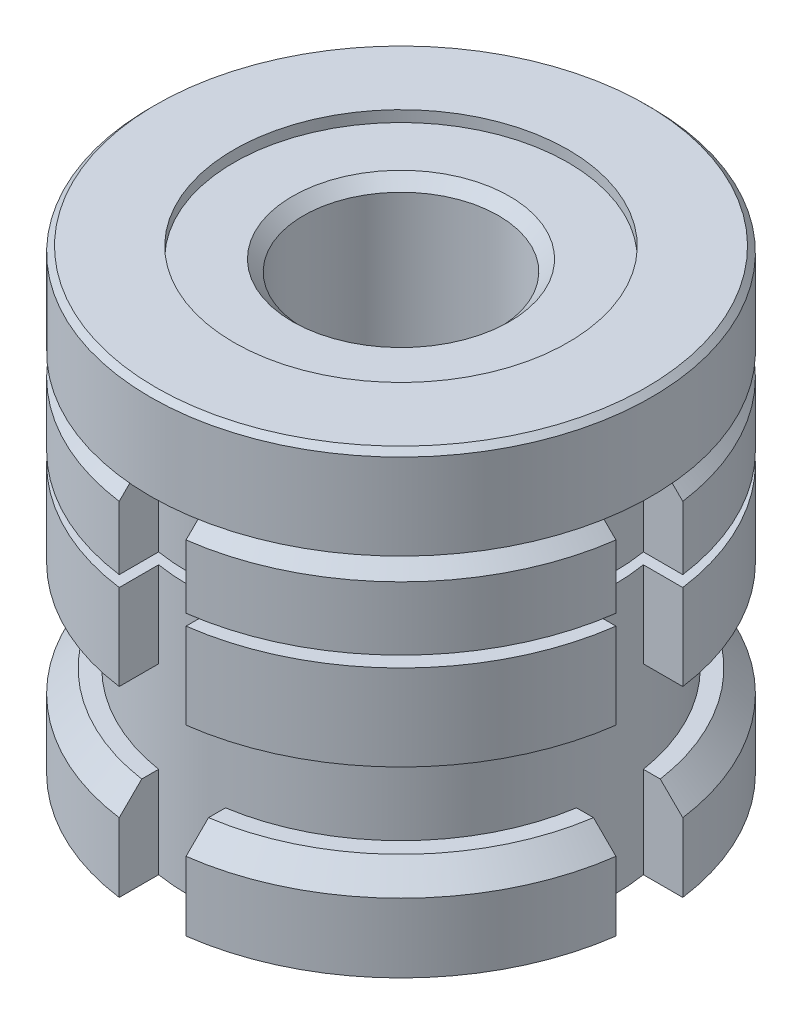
ISO-10303-21;
HEADER;
FILE_DESCRIPTION(('STEP AP214'),'2;1');
FILE_NAME('part.step','',(''),(''),'','','');
FILE_SCHEMA(('AUTOMOTIVE_DESIGN { 1 0 10303 214 1 1 1 1 }'));
ENDSEC;
DATA;
#1=APPLICATION_CONTEXT('core data for automotive mechanical design processes');
#2=APPLICATION_PROTOCOL_DEFINITION('international standard','automotive_design',2000,#1);
#3=PRODUCT_CONTEXT('',#1,'mechanical');
#4=PRODUCT('Part','Part','',(#3));
#5=PRODUCT_RELATED_PRODUCT_CATEGORY('part','',(#4));
#6=PRODUCT_DEFINITION_FORMATION('','',#4);
#7=PRODUCT_DEFINITION_CONTEXT('part definition',#1,'design');
#8=PRODUCT_DEFINITION('design','',#6,#7);
#9=PRODUCT_DEFINITION_SHAPE('','',#8);
#10=(LENGTH_UNIT() NAMED_UNIT(*) SI_UNIT(.MILLI.,.METRE.));
#11=(NAMED_UNIT(*) PLANE_ANGLE_UNIT() SI_UNIT($,.RADIAN.));
#12=(NAMED_UNIT(*) SI_UNIT($,.STERADIAN.) SOLID_ANGLE_UNIT());
#13=UNCERTAINTY_MEASURE_WITH_UNIT(LENGTH_MEASURE(1.E-05),#10,'distance_accuracy_value','');
#14=(GEOMETRIC_REPRESENTATION_CONTEXT(3) GLOBAL_UNCERTAINTY_ASSIGNED_CONTEXT((#13)) GLOBAL_UNIT_ASSIGNED_CONTEXT((#10,
#11,#12)) REPRESENTATION_CONTEXT('',''));
#15=CARTESIAN_POINT('',(0.,0.,0.));
#16=DIRECTION('',(0.,0.,1.));
#17=DIRECTION('',(1.,0.,0.));
#18=AXIS2_PLACEMENT_3D('',#15,#16,#17);
#19=CARTESIAN_POINT('',(0.,16.4,0.));
#20=DIRECTION('',(0.,-1.,0.));
#21=DIRECTION('',(0.,0.,-1.));
#22=AXIS2_PLACEMENT_3D('',#19,#20,#21);
#23=CYLINDRICAL_SURFACE('',#22,22.5);
#24=DIRECTION('',(0.,1.,0.));
#25=VECTOR('',#24,1.);
#26=CARTESIAN_POINT('',(-3.00000000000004,-23.4693113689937,22.2991031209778));
#27=LINE('',#26,#25);
#28=CARTESIAN_POINT('',(-3.00000000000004,8.69999999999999,22.2991031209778));
#29=VERTEX_POINT('',#28);
#30=CARTESIAN_POINT('',(-3.00000000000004,14.4,22.2991031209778));
#31=VERTEX_POINT('',#30);
#32=EDGE_CURVE('E1113',#29,#31,#27,.T.);
#33=ORIENTED_EDGE('',*,*,#32,.T.);
#34=CARTESIAN_POINT('',(0.,14.4,0.));
#35=DIRECTION('',(0.,1.,0.));
#36=DIRECTION('',(0.,0.,1.));
#37=AXIS2_PLACEMENT_3D('',#34,#35,#36);
#38=CIRCLE('',#37,22.5);
#39=CARTESIAN_POINT('',(-22.2991031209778,14.4,3.));
#40=VERTEX_POINT('',#39);
#41=EDGE_CURVE('E55',#31,#40,#38,.F.);
#42=ORIENTED_EDGE('',*,*,#41,.T.);
#43=DIRECTION('',(0.,1.,0.));
#44=VECTOR('',#43,1.);
#45=CARTESIAN_POINT('',(-22.2991031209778,-23.4693113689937,3.));
#46=LINE('',#45,#44);
#47=CARTESIAN_POINT('',(-22.2991031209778,8.69999999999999,3.));
#48=VERTEX_POINT('',#47);
#49=EDGE_CURVE('E866',#48,#40,#46,.T.);
#50=ORIENTED_EDGE('',*,*,#49,.F.);
#51=CARTESIAN_POINT('',(0.,8.7,0.));
#52=DIRECTION('',(0.,1.,0.));
#53=DIRECTION('',(0.,0.,1.));
#54=AXIS2_PLACEMENT_3D('',#51,#52,#53);
#55=CIRCLE('',#54,22.5);
#56=EDGE_CURVE('E589',#48,#29,#55,.T.);
#57=ORIENTED_EDGE('',*,*,#56,.T.);
#58=EDGE_LOOP('',(#33,#42,#50,#57));
#59=FACE_BOUND('',#58,.T.);
#60=ADVANCED_FACE('F39',(#59),#23,.T.);
#61=DIRECTION('',(0.,1.,0.));
#62=VECTOR('',#61,1.);
#63=CARTESIAN_POINT('',(-22.2991031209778,-23.4693113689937,-3.));
#64=LINE('',#63,#62);
#65=CARTESIAN_POINT('',(-22.2991031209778,8.7,-3.));
#66=VERTEX_POINT('',#65);
#67=CARTESIAN_POINT('',(-22.2991031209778,14.4,-3.));
#68=VERTEX_POINT('',#67);
#69=EDGE_CURVE('E884',#66,#68,#64,.T.);
#70=ORIENTED_EDGE('',*,*,#69,.T.);
#71=CARTESIAN_POINT('',(0.,14.4,0.));
#72=DIRECTION('',(0.,1.,0.));
#73=DIRECTION('',(0.,0.,1.));
#74=AXIS2_PLACEMENT_3D('',#71,#72,#73);
#75=CIRCLE('',#74,22.5);
#76=CARTESIAN_POINT('',(-3.00000000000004,14.4,-22.2991031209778));
#77=VERTEX_POINT('',#76);
#78=EDGE_CURVE('E647',#68,#77,#75,.F.);
#79=ORIENTED_EDGE('',*,*,#78,.T.);
#80=DIRECTION('',(0.,1.,0.));
#81=VECTOR('',#80,1.);
#82=CARTESIAN_POINT('',(-3.00000000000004,-23.4693113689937,-22.2991031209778));
#83=LINE('',#82,#81);
#84=CARTESIAN_POINT('',(-3.00000000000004,8.69999999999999,-22.2991031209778));
#85=VERTEX_POINT('',#84);
#86=EDGE_CURVE('E463',#85,#77,#83,.T.);
#87=ORIENTED_EDGE('',*,*,#86,.F.);
#88=EDGE_CURVE('E1230',#85,#66,#55,.T.);
#89=ORIENTED_EDGE('',*,*,#88,.T.);
#90=EDGE_LOOP('',(#70,#79,#87,#89));
#91=FACE_BOUND('',#90,.T.);
#92=ADVANCED_FACE('F1248',(#91),#23,.T.);
#93=DIRECTION('',(0.,1.,0.));
#94=VECTOR('',#93,1.);
#95=CARTESIAN_POINT('',(22.2991031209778,-23.4693113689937,2.9999999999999));
#96=LINE('',#95,#94);
#97=CARTESIAN_POINT('',(22.2991031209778,8.69999999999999,2.9999999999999));
#98=VERTEX_POINT('',#97);
#99=CARTESIAN_POINT('',(22.2991031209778,14.4,2.9999999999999));
#100=VERTEX_POINT('',#99);
#101=EDGE_CURVE('E1025',#98,#100,#96,.T.);
#102=ORIENTED_EDGE('',*,*,#101,.T.);
#103=CARTESIAN_POINT('',(0.,14.4,0.));
#104=DIRECTION('',(0.,1.,0.));
#105=DIRECTION('',(0.,0.,1.));
#106=AXIS2_PLACEMENT_3D('',#103,#104,#105);
#107=CIRCLE('',#106,22.5);
#108=CARTESIAN_POINT('',(3.00000000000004,14.4,22.2991031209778));
#109=VERTEX_POINT('',#108);
#110=EDGE_CURVE('E728',#100,#109,#107,.F.);
#111=ORIENTED_EDGE('',*,*,#110,.T.);
#112=DIRECTION('',(0.,1.,0.));
#113=VECTOR('',#112,1.);
#114=CARTESIAN_POINT('',(3.00000000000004,-23.4693113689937,22.2991031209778));
#115=LINE('',#114,#113);
#116=CARTESIAN_POINT('',(3.00000000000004,8.69999999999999,22.2991031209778));
#117=VERTEX_POINT('',#116);
#118=EDGE_CURVE('E1104',#117,#109,#115,.T.);
#119=ORIENTED_EDGE('',*,*,#118,.F.);
#120=EDGE_CURVE('E590',#117,#98,#55,.T.);
#121=ORIENTED_EDGE('',*,*,#120,.T.);
#122=EDGE_LOOP('',(#102,#111,#119,#121));
#123=FACE_BOUND('',#122,.T.);
#124=ADVANCED_FACE('F1102',(#123),#23,.T.);
#125=CARTESIAN_POINT('',(0.,8.7,22.5));
#126=DIRECTION('',(0.,1.,0.));
#127=DIRECTION('',(0.,0.,1.));
#128=AXIS2_PLACEMENT_3D('',#125,#126,#127);
#129=PLANE('',#128);
#130=CARTESIAN_POINT('',(0.,8.70000000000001,0.));
#131=DIRECTION('',(0.,1.,0.));
#132=DIRECTION('',(0.,0.,1.));
#133=AXIS2_PLACEMENT_3D('',#130,#131,#132);
#134=CIRCLE('',#133,15.);
#135=CARTESIAN_POINT('',(0.,8.70000000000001,15.));
#136=VERTEX_POINT('',#135);
#137=EDGE_CURVE('E594',#136,#136,#134,.T.);
#138=ORIENTED_EDGE('',*,*,#137,.T.);
#139=EDGE_LOOP('',(#138));
#140=FACE_BOUND('',#139,.T.);
#141=ORIENTED_EDGE('',*,*,#56,.F.);
#142=DIRECTION('',(1.,0.,0.));
#143=VECTOR('',#142,1.);
#144=CARTESIAN_POINT('',(0.,8.7,3.));
#145=LINE('',#144,#143);
#146=CARTESIAN_POINT('',(-18.7616630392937,8.69999999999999,3.));
#147=VERTEX_POINT('',#146);
#148=EDGE_CURVE('E565',#48,#147,#145,.T.);
#149=ORIENTED_EDGE('',*,*,#148,.T.);
#150=CARTESIAN_POINT('',(0.,8.7,0.));
#151=DIRECTION('',(0.,1.,0.));
#152=DIRECTION('',(0.,0.,1.));
#153=AXIS2_PLACEMENT_3D('',#150,#151,#152);
#154=CIRCLE('',#153,19.);
#155=CARTESIAN_POINT('',(-18.7616630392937,8.69999999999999,-3.));
#156=VERTEX_POINT('',#155);
#157=EDGE_CURVE('E549',#147,#156,#154,.F.);
#158=ORIENTED_EDGE('',*,*,#157,.T.);
#159=DIRECTION('',(-1.,0.,0.));
#160=VECTOR('',#159,1.);
#161=CARTESIAN_POINT('',(0.,8.7,-3.));
#162=LINE('',#161,#160);
#163=EDGE_CURVE('E542',#156,#66,#162,.T.);
#164=ORIENTED_EDGE('',*,*,#163,.T.);
#165=ORIENTED_EDGE('',*,*,#88,.F.);
#166=DIRECTION('',(0.,0.,1.));
#167=VECTOR('',#166,1.);
#168=CARTESIAN_POINT('',(-3.00000000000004,8.7,22.5));
#169=LINE('',#168,#167);
#170=CARTESIAN_POINT('',(-3.00000000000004,8.69999999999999,-18.7616630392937));
#171=VERTEX_POINT('',#170);
#172=EDGE_CURVE('E528',#85,#171,#169,.T.);
#173=ORIENTED_EDGE('',*,*,#172,.T.);
#174=CARTESIAN_POINT('',(0.,8.7,0.));
#175=DIRECTION('',(0.,1.,0.));
#176=DIRECTION('',(0.,0.,1.));
#177=AXIS2_PLACEMENT_3D('',#174,#175,#176);
#178=CIRCLE('',#177,19.);
#179=CARTESIAN_POINT('',(3.00000000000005,8.69999999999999,-18.7616630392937));
#180=VERTEX_POINT('',#179);
#181=EDGE_CURVE('E422',#171,#180,#178,.F.);
#182=ORIENTED_EDGE('',*,*,#181,.T.);
#183=DIRECTION('',(0.,0.,-1.));
#184=VECTOR('',#183,1.);
#185=CARTESIAN_POINT('',(3.00000000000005,8.7,22.5));
#186=LINE('',#185,#184);
#187=CARTESIAN_POINT('',(3.00000000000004,8.7,-22.2991031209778));
#188=VERTEX_POINT('',#187);
#189=EDGE_CURVE('E501',#180,#188,#186,.T.);
#190=ORIENTED_EDGE('',*,*,#189,.T.);
#191=CARTESIAN_POINT('',(22.2991031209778,8.69999999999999,-3.));
#192=VERTEX_POINT('',#191);
#193=EDGE_CURVE('E595',#192,#188,#55,.T.);
#194=ORIENTED_EDGE('',*,*,#193,.F.);
#195=DIRECTION('',(-1.,0.,0.));
#196=VECTOR('',#195,1.);
#197=CARTESIAN_POINT('',(0.,8.7,-3.));
#198=LINE('',#197,#196);
#199=CARTESIAN_POINT('',(18.7616630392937,8.69999999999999,-3.));
#200=VERTEX_POINT('',#199);
#201=EDGE_CURVE('E1070',#192,#200,#198,.T.);
#202=ORIENTED_EDGE('',*,*,#201,.T.);
#203=CARTESIAN_POINT('',(0.,8.7,0.));
#204=DIRECTION('',(0.,1.,0.));
#205=DIRECTION('',(0.,0.,1.));
#206=AXIS2_PLACEMENT_3D('',#203,#204,#205);
#207=CIRCLE('',#206,19.);
#208=CARTESIAN_POINT('',(18.7616630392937,8.7,2.9999999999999));
#209=VERTEX_POINT('',#208);
#210=EDGE_CURVE('E1068',#200,#209,#207,.F.);
#211=ORIENTED_EDGE('',*,*,#210,.T.);
#212=DIRECTION('',(1.,0.,0.));
#213=VECTOR('',#212,1.);
#214=CARTESIAN_POINT('',(0.,8.7,2.9999999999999));
#215=LINE('',#214,#213);
#216=EDGE_CURVE('E993',#209,#98,#215,.T.);
#217=ORIENTED_EDGE('',*,*,#216,.T.);
#218=ORIENTED_EDGE('',*,*,#120,.F.);
#219=DIRECTION('',(0.,0.,-1.));
#220=VECTOR('',#219,1.);
#221=CARTESIAN_POINT('',(3.00000000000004,8.7,22.5));
#222=LINE('',#221,#220);
#223=CARTESIAN_POINT('',(3.00000000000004,8.69999999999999,18.7616630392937));
#224=VERTEX_POINT('',#223);
#225=EDGE_CURVE('E847',#117,#224,#222,.T.);
#226=ORIENTED_EDGE('',*,*,#225,.T.);
#227=CARTESIAN_POINT('',(0.,8.7,0.));
#228=DIRECTION('',(0.,1.,0.));
#229=DIRECTION('',(0.,0.,1.));
#230=AXIS2_PLACEMENT_3D('',#227,#228,#229);
#231=CIRCLE('',#230,19.);
#232=CARTESIAN_POINT('',(-3.00000000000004,8.7,18.7616630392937));
#233=VERTEX_POINT('',#232);
#234=EDGE_CURVE('E871',#224,#233,#231,.F.);
#235=ORIENTED_EDGE('',*,*,#234,.T.);
#236=DIRECTION('',(0.,0.,1.));
#237=VECTOR('',#236,1.);
#238=CARTESIAN_POINT('',(-3.00000000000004,8.7,22.5));
#239=LINE('',#238,#237);
#240=EDGE_CURVE('E1158',#233,#29,#239,.T.);
#241=ORIENTED_EDGE('',*,*,#240,.T.);
#242=EDGE_LOOP('',(#141,#149,#158,#164,#165,#173,#182,#190,#194,#202,#211,#217,#218,#226,#235,#241));
#243=FACE_BOUND('',#242,.T.);
#244=ADVANCED_FACE('F1074',(#140,#243),#129,.F.);
#245=CARTESIAN_POINT('',(0.,7.7,22.5));
#246=DIRECTION('',(0.,-1.,0.));
#247=DIRECTION('',(0.,0.,-1.));
#248=AXIS2_PLACEMENT_3D('',#245,#246,#247);
#249=PLANE('',#248);
#250=CARTESIAN_POINT('',(0.,7.7,0.));
#251=DIRECTION('',(0.,1.,0.));
#252=DIRECTION('',(0.,0.,1.));
#253=AXIS2_PLACEMENT_3D('',#250,#251,#252);
#254=CIRCLE('',#253,15.);
#255=CARTESIAN_POINT('',(0.,7.7,15.));
#256=VERTEX_POINT('',#255);
#257=EDGE_CURVE('E573',#256,#256,#254,.T.);
#258=ORIENTED_EDGE('',*,*,#257,.F.);
#259=EDGE_LOOP('',(#258));
#260=FACE_BOUND('',#259,.T.);
#261=CARTESIAN_POINT('',(0.,7.7,0.));
#262=DIRECTION('',(0.,-1.,0.));
#263=DIRECTION('',(0.,0.,-1.));
#264=AXIS2_PLACEMENT_3D('',#261,#262,#263);
#265=CIRCLE('',#264,19.);
#266=CARTESIAN_POINT('',(-18.7616630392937,7.69999999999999,-3.));
#267=VERTEX_POINT('',#266);
#268=CARTESIAN_POINT('',(-18.7616630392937,7.69999999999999,3.));
#269=VERTEX_POINT('',#268);
#270=EDGE_CURVE('E546',#267,#269,#265,.F.);
#271=ORIENTED_EDGE('',*,*,#270,.T.);
#272=DIRECTION('',(-1.,0.,0.));
#273=VECTOR('',#272,1.);
#274=CARTESIAN_POINT('',(0.,7.7,3.));
#275=LINE('',#274,#273);
#276=CARTESIAN_POINT('',(-22.2991031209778,7.69999999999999,3.));
#277=VERTEX_POINT('',#276);
#278=EDGE_CURVE('E561',#269,#277,#275,.T.);
#279=ORIENTED_EDGE('',*,*,#278,.T.);
#280=CARTESIAN_POINT('',(0.,7.7,0.));
#281=DIRECTION('',(0.,1.,0.));
#282=DIRECTION('',(0.,0.,1.));
#283=AXIS2_PLACEMENT_3D('',#280,#281,#282);
#284=CIRCLE('',#283,22.5);
#285=CARTESIAN_POINT('',(-3.00000000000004,7.69999999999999,22.2991031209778));
#286=VERTEX_POINT('',#285);
#287=EDGE_CURVE('E584',#277,#286,#284,.T.);
#288=ORIENTED_EDGE('',*,*,#287,.T.);
#289=DIRECTION('',(0.,0.,-1.));
#290=VECTOR('',#289,1.);
#291=CARTESIAN_POINT('',(-3.00000000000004,7.7,22.5));
#292=LINE('',#291,#290);
#293=CARTESIAN_POINT('',(-3.00000000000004,7.69999999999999,18.7616630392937));
#294=VERTEX_POINT('',#293);
#295=EDGE_CURVE('E1153',#286,#294,#292,.T.);
#296=ORIENTED_EDGE('',*,*,#295,.T.);
#297=CARTESIAN_POINT('',(0.,7.7,0.));
#298=DIRECTION('',(0.,-1.,0.));
#299=DIRECTION('',(0.,0.,-1.));
#300=AXIS2_PLACEMENT_3D('',#297,#298,#299);
#301=CIRCLE('',#300,19.);
#302=CARTESIAN_POINT('',(3.00000000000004,7.69999999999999,18.7616630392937));
#303=VERTEX_POINT('',#302);
#304=EDGE_CURVE('E863',#294,#303,#301,.F.);
#305=ORIENTED_EDGE('',*,*,#304,.T.);
#306=DIRECTION('',(0.,0.,1.));
#307=VECTOR('',#306,1.);
#308=CARTESIAN_POINT('',(3.00000000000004,7.7,22.5));
#309=LINE('',#308,#307);
#310=CARTESIAN_POINT('',(3.00000000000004,7.69999999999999,22.2991031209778));
#311=VERTEX_POINT('',#310);
#312=EDGE_CURVE('E1150',#303,#311,#309,.T.);
#313=ORIENTED_EDGE('',*,*,#312,.T.);
#314=CARTESIAN_POINT('',(22.2991031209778,7.69999999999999,2.9999999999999));
#315=VERTEX_POINT('',#314);
#316=EDGE_CURVE('E585',#311,#315,#284,.T.);
#317=ORIENTED_EDGE('',*,*,#316,.T.);
#318=DIRECTION('',(-1.,0.,0.));
#319=VECTOR('',#318,1.);
#320=CARTESIAN_POINT('',(0.,7.7,2.9999999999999));
#321=LINE('',#320,#319);
#322=CARTESIAN_POINT('',(18.7616630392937,7.69999999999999,2.9999999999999));
#323=VERTEX_POINT('',#322);
#324=EDGE_CURVE('E1092',#315,#323,#321,.T.);
#325=ORIENTED_EDGE('',*,*,#324,.T.);
#326=CARTESIAN_POINT('',(0.,7.7,0.));
#327=DIRECTION('',(0.,-1.,0.));
#328=DIRECTION('',(0.,0.,-1.));
#329=AXIS2_PLACEMENT_3D('',#326,#327,#328);
#330=CIRCLE('',#329,19.);
#331=CARTESIAN_POINT('',(18.7616630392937,7.69999999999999,-3.));
#332=VERTEX_POINT('',#331);
#333=EDGE_CURVE('E1164',#323,#332,#330,.F.);
#334=ORIENTED_EDGE('',*,*,#333,.T.);
#335=DIRECTION('',(1.,0.,0.));
#336=VECTOR('',#335,1.);
#337=CARTESIAN_POINT('',(0.,7.7,-3.));
#338=LINE('',#337,#336);
#339=CARTESIAN_POINT('',(22.2991031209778,7.69999999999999,-3.));
#340=VERTEX_POINT('',#339);
#341=EDGE_CURVE('E1078',#332,#340,#338,.T.);
#342=ORIENTED_EDGE('',*,*,#341,.T.);
#343=CARTESIAN_POINT('',(3.00000000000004,7.7,-22.2991031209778));
#344=VERTEX_POINT('',#343);
#345=EDGE_CURVE('E499',#340,#344,#284,.T.);
#346=ORIENTED_EDGE('',*,*,#345,.T.);
#347=DIRECTION('',(0.,0.,1.));
#348=VECTOR('',#347,1.);
#349=CARTESIAN_POINT('',(3.00000000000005,7.7,22.5));
#350=LINE('',#349,#348);
#351=CARTESIAN_POINT('',(3.00000000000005,7.69999999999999,-18.7616630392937));
#352=VERTEX_POINT('',#351);
#353=EDGE_CURVE('E483',#344,#352,#350,.T.);
#354=ORIENTED_EDGE('',*,*,#353,.T.);
#355=CARTESIAN_POINT('',(0.,7.7,0.));
#356=DIRECTION('',(0.,-1.,0.));
#357=DIRECTION('',(0.,0.,-1.));
#358=AXIS2_PLACEMENT_3D('',#355,#356,#357);
#359=CIRCLE('',#358,19.);
#360=CARTESIAN_POINT('',(-3.00000000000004,7.69999999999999,-18.7616630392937));
#361=VERTEX_POINT('',#360);
#362=EDGE_CURVE('E496',#352,#361,#359,.F.);
#363=ORIENTED_EDGE('',*,*,#362,.T.);
#364=DIRECTION('',(0.,0.,-1.));
#365=VECTOR('',#364,1.);
#366=CARTESIAN_POINT('',(-3.00000000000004,7.7,22.5));
#367=LINE('',#366,#365);
#368=CARTESIAN_POINT('',(-3.00000000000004,7.69999999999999,-22.2991031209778));
#369=VERTEX_POINT('',#368);
#370=EDGE_CURVE('E525',#361,#369,#367,.T.);
#371=ORIENTED_EDGE('',*,*,#370,.T.);
#372=CARTESIAN_POINT('',(-22.2991031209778,7.7,-3.));
#373=VERTEX_POINT('',#372);
#374=EDGE_CURVE('E1307',#369,#373,#284,.T.);
#375=ORIENTED_EDGE('',*,*,#374,.T.);
#376=DIRECTION('',(1.,0.,0.));
#377=VECTOR('',#376,1.);
#378=CARTESIAN_POINT('',(0.,7.7,-3.));
#379=LINE('',#378,#377);
#380=EDGE_CURVE('E538',#373,#267,#379,.T.);
#381=ORIENTED_EDGE('',*,*,#380,.T.);
#382=EDGE_LOOP('',(#271,#279,#288,#296,#305,#313,#317,#325,#334,#342,#346,#354,#363,#371,#375,#381));
#383=FACE_BOUND('',#382,.T.);
#384=ADVANCED_FACE('F494',(#260,#383),#249,.F.);
#385=CARTESIAN_POINT('',(0.,0.,0.));
#386=DIRECTION('',(0.,1.,0.));
#387=DIRECTION('',(0.,0.,1.));
#388=AXIS2_PLACEMENT_3D('',#385,#386,#387);
#389=PLANE('',#388);
#390=CARTESIAN_POINT('',(0.,0.,0.));
#391=DIRECTION('',(0.,1.,0.));
#392=DIRECTION('',(0.,0.,1.));
#393=AXIS2_PLACEMENT_3D('',#390,#391,#392);
#394=CIRCLE('',#393,22.5);
#395=CARTESIAN_POINT('',(-22.2991031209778,0.,3.));
#396=VERTEX_POINT('',#395);
#397=CARTESIAN_POINT('',(-3.00000000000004,0.,22.2991031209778));
#398=VERTEX_POINT('',#397);
#399=EDGE_CURVE('E599',#396,#398,#394,.T.);
#400=ORIENTED_EDGE('',*,*,#399,.F.);
#401=DIRECTION('',(1.,0.,0.));
#402=VECTOR('',#401,1.);
#403=CARTESIAN_POINT('',(0.,0.,3.));
#404=LINE('',#403,#402);
#405=CARTESIAN_POINT('',(-18.7616630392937,0.,3.));
#406=VERTEX_POINT('',#405);
#407=EDGE_CURVE('E557',#396,#406,#404,.T.);
#408=ORIENTED_EDGE('',*,*,#407,.T.);
#409=CARTESIAN_POINT('',(0.,0.,0.));
#410=DIRECTION('',(0.,-1.,0.));
#411=DIRECTION('',(0.,0.,-1.));
#412=AXIS2_PLACEMENT_3D('',#409,#410,#411);
#413=CIRCLE('',#412,19.);
#414=CARTESIAN_POINT('',(-3.00000000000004,0.,18.7616630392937));
#415=VERTEX_POINT('',#414);
#416=EDGE_CURVE('E1298',#415,#406,#413,.T.);
#417=ORIENTED_EDGE('',*,*,#416,.F.);
#418=DIRECTION('',(0.,0.,1.));
#419=VECTOR('',#418,1.);
#420=CARTESIAN_POINT('',(-3.00000000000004,0.,0.));
#421=LINE('',#420,#419);
#422=EDGE_CURVE('E846',#415,#398,#421,.T.);
#423=ORIENTED_EDGE('',*,*,#422,.T.);
#424=EDGE_LOOP('',(#400,#408,#417,#423));
#425=FACE_BOUND('',#424,.T.);
#426=ADVANCED_FACE('F1263',(#425),#389,.F.);
#427=CARTESIAN_POINT('',(-18.7616630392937,0.,-3.));
#428=VERTEX_POINT('',#427);
#429=CARTESIAN_POINT('',(-3.00000000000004,0.,-18.7616630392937));
#430=VERTEX_POINT('',#429);
#431=EDGE_CURVE('E580',#428,#430,#413,.T.);
#432=ORIENTED_EDGE('',*,*,#431,.F.);
#433=DIRECTION('',(-1.,0.,0.));
#434=VECTOR('',#433,1.);
#435=CARTESIAN_POINT('',(0.,0.,-3.));
#436=LINE('',#435,#434);
#437=CARTESIAN_POINT('',(-22.2991031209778,0.,-3.));
#438=VERTEX_POINT('',#437);
#439=EDGE_CURVE('E534',#428,#438,#436,.T.);
#440=ORIENTED_EDGE('',*,*,#439,.T.);
#441=CARTESIAN_POINT('',(-3.00000000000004,0.,-22.2991031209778));
#442=VERTEX_POINT('',#441);
#443=EDGE_CURVE('E1289',#442,#438,#394,.T.);
#444=ORIENTED_EDGE('',*,*,#443,.F.);
#445=DIRECTION('',(0.,0.,1.));
#446=VECTOR('',#445,1.);
#447=CARTESIAN_POINT('',(-3.00000000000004,0.,0.));
#448=LINE('',#447,#446);
#449=EDGE_CURVE('E521',#442,#430,#448,.T.);
#450=ORIENTED_EDGE('',*,*,#449,.T.);
#451=EDGE_LOOP('',(#432,#440,#444,#450));
#452=FACE_BOUND('',#451,.T.);
#453=ADVANCED_FACE('F1305',(#452),#389,.F.);
#454=CARTESIAN_POINT('',(18.7616630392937,0.,2.9999999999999));
#455=VERTEX_POINT('',#454);
#456=CARTESIAN_POINT('',(3.00000000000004,0.,18.7616630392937));
#457=VERTEX_POINT('',#456);
#458=EDGE_CURVE('E579',#455,#457,#413,.T.);
#459=ORIENTED_EDGE('',*,*,#458,.F.);
#460=DIRECTION('',(1.,0.,0.));
#461=VECTOR('',#460,1.);
#462=CARTESIAN_POINT('',(0.,0.,2.9999999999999));
#463=LINE('',#462,#461);
#464=CARTESIAN_POINT('',(22.2991031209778,0.,2.9999999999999));
#465=VERTEX_POINT('',#464);
#466=EDGE_CURVE('E1082',#455,#465,#463,.T.);
#467=ORIENTED_EDGE('',*,*,#466,.T.);
#468=CARTESIAN_POINT('',(3.00000000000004,0.,22.2991031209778));
#469=VERTEX_POINT('',#468);
#470=EDGE_CURVE('E600',#469,#465,#394,.T.);
#471=ORIENTED_EDGE('',*,*,#470,.F.);
#472=DIRECTION('',(0.,0.,-1.));
#473=VECTOR('',#472,1.);
#474=CARTESIAN_POINT('',(3.00000000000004,0.,0.));
#475=LINE('',#474,#473);
#476=EDGE_CURVE('E1190',#469,#457,#475,.T.);
#477=ORIENTED_EDGE('',*,*,#476,.T.);
#478=EDGE_LOOP('',(#459,#467,#471,#477));
#479=FACE_BOUND('',#478,.T.);
#480=ADVANCED_FACE('F1189',(#479),#389,.F.);
#481=ORIENTED_EDGE('',*,*,#287,.F.);
#482=EDGE_CURVE('E864',#396,#277,#46,.T.);
#483=ORIENTED_EDGE('',*,*,#482,.F.);
#484=ORIENTED_EDGE('',*,*,#399,.T.);
#485=EDGE_CURVE('E1111',#398,#286,#27,.T.);
#486=ORIENTED_EDGE('',*,*,#485,.T.);
#487=EDGE_LOOP('',(#481,#483,#484,#486));
#488=FACE_BOUND('',#487,.T.);
#489=ADVANCED_FACE('F1280',(#488),#23,.T.);
#490=ORIENTED_EDGE('',*,*,#443,.T.);
#491=EDGE_CURVE('E882',#438,#373,#64,.T.);
#492=ORIENTED_EDGE('',*,*,#491,.T.);
#493=ORIENTED_EDGE('',*,*,#374,.F.);
#494=EDGE_CURVE('E954',#442,#369,#83,.T.);
#495=ORIENTED_EDGE('',*,*,#494,.F.);
#496=EDGE_LOOP('',(#490,#492,#493,#495));
#497=FACE_BOUND('',#496,.T.);
#498=ADVANCED_FACE('F1274',(#497),#23,.T.);
#499=ORIENTED_EDGE('',*,*,#470,.T.);
#500=EDGE_CURVE('E1024',#465,#315,#96,.T.);
#501=ORIENTED_EDGE('',*,*,#500,.T.);
#502=ORIENTED_EDGE('',*,*,#316,.F.);
#503=EDGE_CURVE('E1107',#469,#311,#115,.T.);
#504=ORIENTED_EDGE('',*,*,#503,.F.);
#505=EDGE_LOOP('',(#499,#501,#502,#504));
#506=FACE_BOUND('',#505,.T.);
#507=ADVANCED_FACE('F1185',(#506),#23,.T.);
#508=CARTESIAN_POINT('',(0.,-8.2,0.));
#509=DIRECTION('',(0.,-1.,0.));
#510=DIRECTION('',(0.,0.,-1.));
#511=AXIS2_PLACEMENT_3D('',#508,#509,#510);
#512=CYLINDRICAL_SURFACE('',#511,22.5);
#513=CARTESIAN_POINT('',(-3.00000000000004,-16.4,22.2991031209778));
#514=VERTEX_POINT('',#513);
#515=CARTESIAN_POINT('',(-3.00000000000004,-10.2,22.2991031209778));
#516=VERTEX_POINT('',#515);
#517=EDGE_CURVE('E857',#514,#516,#27,.T.);
#518=ORIENTED_EDGE('',*,*,#517,.T.);
#519=CARTESIAN_POINT('',(0.,-10.2,0.));
#520=DIRECTION('',(0.,-1.,0.));
#521=DIRECTION('',(0.,0.,-1.));
#522=AXIS2_PLACEMENT_3D('',#519,#520,#521);
#523=CIRCLE('',#522,22.5);
#524=CARTESIAN_POINT('',(-22.2991031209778,-10.2,3.));
#525=VERTEX_POINT('',#524);
#526=EDGE_CURVE('E776',#516,#525,#523,.T.);
#527=ORIENTED_EDGE('',*,*,#526,.T.);
#528=CARTESIAN_POINT('',(-22.2991031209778,-16.4,3.));
#529=VERTEX_POINT('',#528);
#530=EDGE_CURVE('E855',#529,#525,#46,.T.);
#531=ORIENTED_EDGE('',*,*,#530,.F.);
#532=CARTESIAN_POINT('',(0.,-16.4,0.));
#533=DIRECTION('',(0.,-1.,0.));
#534=DIRECTION('',(0.,0.,-1.));
#535=AXIS2_PLACEMENT_3D('',#532,#533,#534);
#536=CIRCLE('',#535,22.5);
#537=EDGE_CURVE('E1319',#514,#529,#536,.T.);
#538=ORIENTED_EDGE('',*,*,#537,.F.);
#539=EDGE_LOOP('',(#518,#527,#531,#538));
#540=FACE_BOUND('',#539,.T.);
#541=ADVANCED_FACE('F853',(#540),#512,.T.);
#542=CARTESIAN_POINT('',(-22.2991031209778,-16.4,-3.));
#543=VERTEX_POINT('',#542);
#544=CARTESIAN_POINT('',(-22.2991031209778,-10.2,-3.));
#545=VERTEX_POINT('',#544);
#546=EDGE_CURVE('E877',#543,#545,#64,.T.);
#547=ORIENTED_EDGE('',*,*,#546,.T.);
#548=CARTESIAN_POINT('',(0.,-10.2,0.));
#549=DIRECTION('',(0.,-1.,0.));
#550=DIRECTION('',(0.,0.,-1.));
#551=AXIS2_PLACEMENT_3D('',#548,#549,#550);
#552=CIRCLE('',#551,22.5);
#553=CARTESIAN_POINT('',(-3.00000000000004,-10.2,-22.2991031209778));
#554=VERTEX_POINT('',#553);
#555=EDGE_CURVE('E609',#545,#554,#552,.T.);
#556=ORIENTED_EDGE('',*,*,#555,.T.);
#557=CARTESIAN_POINT('',(-3.00000000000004,-16.4,-22.2991031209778));
#558=VERTEX_POINT('',#557);
#559=EDGE_CURVE('E951',#558,#554,#83,.T.);
#560=ORIENTED_EDGE('',*,*,#559,.F.);
#561=EDGE_CURVE('E569',#543,#558,#536,.T.);
#562=ORIENTED_EDGE('',*,*,#561,.F.);
#563=EDGE_LOOP('',(#547,#556,#560,#562));
#564=FACE_BOUND('',#563,.T.);
#565=ADVANCED_FACE('F1279',(#564),#512,.T.);
#566=CARTESIAN_POINT('',(22.2991031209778,-16.4,2.9999999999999));
#567=VERTEX_POINT('',#566);
#568=CARTESIAN_POINT('',(22.2991031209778,-10.2,2.9999999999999));
#569=VERTEX_POINT('',#568);
#570=EDGE_CURVE('E1018',#567,#569,#96,.T.);
#571=ORIENTED_EDGE('',*,*,#570,.T.);
#572=CARTESIAN_POINT('',(0.,-10.2,0.));
#573=DIRECTION('',(0.,-1.,0.));
#574=DIRECTION('',(0.,0.,-1.));
#575=AXIS2_PLACEMENT_3D('',#572,#573,#574);
#576=CIRCLE('',#575,22.5);
#577=CARTESIAN_POINT('',(3.00000000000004,-10.2,22.2991031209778));
#578=VERTEX_POINT('',#577);
#579=EDGE_CURVE('E747',#569,#578,#576,.T.);
#580=ORIENTED_EDGE('',*,*,#579,.T.);
#581=CARTESIAN_POINT('',(3.00000000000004,-16.4,22.2991031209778));
#582=VERTEX_POINT('',#581);
#583=EDGE_CURVE('E1109',#582,#578,#115,.T.);
#584=ORIENTED_EDGE('',*,*,#583,.F.);
#585=EDGE_CURVE('E574',#567,#582,#536,.T.);
#586=ORIENTED_EDGE('',*,*,#585,.F.);
#587=EDGE_LOOP('',(#571,#580,#584,#586));
#588=FACE_BOUND('',#587,.T.);
#589=ADVANCED_FACE('F1261',(#588),#512,.T.);
#590=CARTESIAN_POINT('',(0.,-8.2,0.));
#591=DIRECTION('',(0.,-1.,0.));
#592=DIRECTION('',(0.,0.,-1.));
#593=AXIS2_PLACEMENT_3D('',#590,#591,#592);
#594=PLANE('',#593);
#595=DIRECTION('',(-1.,0.,0.));
#596=VECTOR('',#595,1.);
#597=CARTESIAN_POINT('',(0.,-8.2,3.));
#598=LINE('',#597,#596);
#599=CARTESIAN_POINT('',(-18.7616630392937,-8.2,3.));
#600=VERTEX_POINT('',#599);
#601=CARTESIAN_POINT('',(-20.2792997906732,-8.2,3.));
#602=VERTEX_POINT('',#601);
#603=EDGE_CURVE('E553',#600,#602,#598,.T.);
#604=ORIENTED_EDGE('',*,*,#603,.T.);
#605=CARTESIAN_POINT('',(0.,-8.2,0.));
#606=DIRECTION('',(0.,-1.,0.));
#607=DIRECTION('',(0.,0.,-1.));
#608=AXIS2_PLACEMENT_3D('',#605,#606,#607);
#609=CIRCLE('',#608,20.5);
#610=CARTESIAN_POINT('',(-3.00000000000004,-8.2,20.2792997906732));
#611=VERTEX_POINT('',#610);
#612=EDGE_CURVE('E786',#602,#611,#609,.F.);
#613=ORIENTED_EDGE('',*,*,#612,.T.);
#614=DIRECTION('',(0.,0.,-1.));
#615=VECTOR('',#614,1.);
#616=CARTESIAN_POINT('',(-3.00000000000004,-8.2,0.));
#617=LINE('',#616,#615);
#618=CARTESIAN_POINT('',(-3.00000000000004,-8.2,18.7616630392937));
#619=VERTEX_POINT('',#618);
#620=EDGE_CURVE('E838',#611,#619,#617,.T.);
#621=ORIENTED_EDGE('',*,*,#620,.T.);
#622=CARTESIAN_POINT('',(0.,-8.2,0.));
#623=DIRECTION('',(0.,-1.,0.));
#624=DIRECTION('',(0.,0.,-1.));
#625=AXIS2_PLACEMENT_3D('',#622,#623,#624);
#626=CIRCLE('',#625,19.);
#627=EDGE_CURVE('E1327',#619,#600,#626,.T.);
#628=ORIENTED_EDGE('',*,*,#627,.T.);
#629=EDGE_LOOP('',(#604,#613,#621,#628));
#630=FACE_BOUND('',#629,.T.);
#631=ADVANCED_FACE('F836',(#630),#594,.F.);
#632=DIRECTION('',(0.,0.,-1.));
#633=VECTOR('',#632,1.);
#634=CARTESIAN_POINT('',(-3.00000000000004,-8.2,0.));
#635=LINE('',#634,#633);
#636=CARTESIAN_POINT('',(-3.00000000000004,-8.2,-18.7616630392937));
#637=VERTEX_POINT('',#636);
#638=CARTESIAN_POINT('',(-3.00000000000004,-8.2,-20.2792997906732));
#639=VERTEX_POINT('',#638);
#640=EDGE_CURVE('E517',#637,#639,#635,.T.);
#641=ORIENTED_EDGE('',*,*,#640,.T.);
#642=CARTESIAN_POINT('',(0.,-8.2,0.));
#643=DIRECTION('',(0.,-1.,0.));
#644=DIRECTION('',(0.,0.,-1.));
#645=AXIS2_PLACEMENT_3D('',#642,#643,#644);
#646=CIRCLE('',#645,20.5);
#647=CARTESIAN_POINT('',(-20.2792997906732,-8.2,-3.));
#648=VERTEX_POINT('',#647);
#649=EDGE_CURVE('E622',#639,#648,#646,.F.);
#650=ORIENTED_EDGE('',*,*,#649,.T.);
#651=DIRECTION('',(1.,0.,0.));
#652=VECTOR('',#651,1.);
#653=CARTESIAN_POINT('',(0.,-8.2,-3.));
#654=LINE('',#653,#652);
#655=CARTESIAN_POINT('',(-18.7616630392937,-8.2,-3.));
#656=VERTEX_POINT('',#655);
#657=EDGE_CURVE('E531',#648,#656,#654,.T.);
#658=ORIENTED_EDGE('',*,*,#657,.T.);
#659=EDGE_CURVE('E578',#656,#637,#626,.T.);
#660=ORIENTED_EDGE('',*,*,#659,.T.);
#661=EDGE_LOOP('',(#641,#650,#658,#660));
#662=FACE_BOUND('',#661,.T.);
#663=ADVANCED_FACE('F1314',(#662),#594,.F.);
#664=DIRECTION('',(0.,0.,1.));
#665=VECTOR('',#664,1.);
#666=CARTESIAN_POINT('',(3.00000000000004,-8.2,0.));
#667=LINE('',#666,#665);
#668=CARTESIAN_POINT('',(3.00000000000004,-8.2,18.7616630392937));
#669=VERTEX_POINT('',#668);
#670=CARTESIAN_POINT('',(3.00000000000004,-8.2,20.2792997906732));
#671=VERTEX_POINT('',#670);
#672=EDGE_CURVE('E1216',#669,#671,#667,.T.);
#673=ORIENTED_EDGE('',*,*,#672,.T.);
#674=CARTESIAN_POINT('',(0.,-8.2,0.));
#675=DIRECTION('',(0.,-1.,0.));
#676=DIRECTION('',(0.,0.,-1.));
#677=AXIS2_PLACEMENT_3D('',#674,#675,#676);
#678=CIRCLE('',#677,20.5);
#679=CARTESIAN_POINT('',(20.2792997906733,-8.2,2.9999999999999));
#680=VERTEX_POINT('',#679);
#681=EDGE_CURVE('E767',#671,#680,#678,.F.);
#682=ORIENTED_EDGE('',*,*,#681,.T.);
#683=DIRECTION('',(-1.,0.,0.));
#684=VECTOR('',#683,1.);
#685=CARTESIAN_POINT('',(0.,-8.2,2.9999999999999));
#686=LINE('',#685,#684);
#687=CARTESIAN_POINT('',(18.7616630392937,-8.2,2.9999999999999));
#688=VERTEX_POINT('',#687);
#689=EDGE_CURVE('E1077',#680,#688,#686,.T.);
#690=ORIENTED_EDGE('',*,*,#689,.T.);
#691=EDGE_CURVE('E610',#688,#669,#626,.T.);
#692=ORIENTED_EDGE('',*,*,#691,.T.);
#693=EDGE_LOOP('',(#673,#682,#690,#692));
#694=FACE_BOUND('',#693,.T.);
#695=ADVANCED_FACE('F1325',(#694),#594,.F.);
#696=CARTESIAN_POINT('',(0.,-16.4,0.));
#697=DIRECTION('',(0.,-1.,0.));
#698=DIRECTION('',(0.,0.,-1.));
#699=AXIS2_PLACEMENT_3D('',#696,#697,#698);
#700=PLANE('',#699);
#701=CARTESIAN_POINT('',(0.,-16.4,0.));
#702=DIRECTION('',(0.,-1.,0.));
#703=DIRECTION('',(0.,0.,-1.));
#704=AXIS2_PLACEMENT_3D('',#701,#702,#703);
#705=CIRCLE('',#704,9.75000000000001);
#706=CARTESIAN_POINT('',(0.,-16.4,-9.75000000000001));
#707=VERTEX_POINT('',#706);
#708=EDGE_CURVE('E1909',#707,#707,#705,.F.);
#709=ORIENTED_EDGE('',*,*,#708,.T.);
#710=EDGE_LOOP('',(#709));
#711=FACE_BOUND('',#710,.T.);
#712=DIRECTION('',(1.,0.,0.));
#713=VECTOR('',#712,1.);
#714=CARTESIAN_POINT('',(-18.7616630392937,-16.4,3.));
#715=LINE('',#714,#713);
#716=CARTESIAN_POINT('',(-18.7616630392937,-16.4,3.));
#717=VERTEX_POINT('',#716);
#718=EDGE_CURVE('E861',#529,#717,#715,.T.);
#719=ORIENTED_EDGE('',*,*,#718,.T.);
#720=CARTESIAN_POINT('',(0.,-16.4,0.));
#721=DIRECTION('',(0.,-1.,0.));
#722=DIRECTION('',(0.,0.,-1.));
#723=AXIS2_PLACEMENT_3D('',#720,#721,#722);
#724=CIRCLE('',#723,19.);
#725=CARTESIAN_POINT('',(-18.7616630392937,-16.4,-3.));
#726=VERTEX_POINT('',#725);
#727=EDGE_CURVE('E914',#717,#726,#724,.T.);
#728=ORIENTED_EDGE('',*,*,#727,.T.);
#729=DIRECTION('',(-1.,0.,0.));
#730=VECTOR('',#729,1.);
#731=CARTESIAN_POINT('',(-22.2991031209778,-16.4,-3.));
#732=LINE('',#731,#730);
#733=EDGE_CURVE('E896',#726,#543,#732,.T.);
#734=ORIENTED_EDGE('',*,*,#733,.T.);
#735=ORIENTED_EDGE('',*,*,#561,.T.);
#736=DIRECTION('',(0.,0.,1.));
#737=VECTOR('',#736,1.);
#738=CARTESIAN_POINT('',(-3.00000000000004,-16.4,-22.2991031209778));
#739=LINE('',#738,#737);
#740=CARTESIAN_POINT('',(-3.00000000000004,-16.4,-18.7616630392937));
#741=VERTEX_POINT('',#740);
#742=EDGE_CURVE('E425',#558,#741,#739,.T.);
#743=ORIENTED_EDGE('',*,*,#742,.T.);
#744=CARTESIAN_POINT('',(0.,-16.4,0.));
#745=DIRECTION('',(0.,-1.,0.));
#746=DIRECTION('',(0.,0.,-1.));
#747=AXIS2_PLACEMENT_3D('',#744,#745,#746);
#748=CIRCLE('',#747,19.);
#749=CARTESIAN_POINT('',(3.00000000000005,-16.4,-18.7616630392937));
#750=VERTEX_POINT('',#749);
#751=EDGE_CURVE('E439',#741,#750,#748,.T.);
#752=ORIENTED_EDGE('',*,*,#751,.T.);
#753=DIRECTION('',(0.,0.,-1.));
#754=VECTOR('',#753,1.);
#755=CARTESIAN_POINT('',(3.00000000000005,-16.4,-18.7616630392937));
#756=LINE('',#755,#754);
#757=CARTESIAN_POINT('',(3.00000000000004,-16.4,-22.2991031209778));
#758=VERTEX_POINT('',#757);
#759=EDGE_CURVE('E459',#750,#758,#756,.T.);
#760=ORIENTED_EDGE('',*,*,#759,.T.);
#761=CARTESIAN_POINT('',(22.2991031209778,-16.4,-3.));
#762=VERTEX_POINT('',#761);
#763=EDGE_CURVE('E570',#758,#762,#536,.T.);
#764=ORIENTED_EDGE('',*,*,#763,.T.);
#765=DIRECTION('',(-1.,0.,0.));
#766=VECTOR('',#765,1.);
#767=CARTESIAN_POINT('',(18.7616630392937,-16.4,-3.));
#768=LINE('',#767,#766);
#769=CARTESIAN_POINT('',(18.7616630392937,-16.4,-3.));
#770=VERTEX_POINT('',#769);
#771=EDGE_CURVE('E1004',#762,#770,#768,.T.);
#772=ORIENTED_EDGE('',*,*,#771,.T.);
#773=CARTESIAN_POINT('',(0.,-16.4,0.));
#774=DIRECTION('',(0.,-1.,0.));
#775=DIRECTION('',(0.,0.,-1.));
#776=AXIS2_PLACEMENT_3D('',#773,#774,#775);
#777=CIRCLE('',#776,19.);
#778=CARTESIAN_POINT('',(18.7616630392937,-16.4,2.9999999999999));
#779=VERTEX_POINT('',#778);
#780=EDGE_CURVE('E1054',#770,#779,#777,.T.);
#781=ORIENTED_EDGE('',*,*,#780,.T.);
#782=DIRECTION('',(1.,0.,0.));
#783=VECTOR('',#782,1.);
#784=CARTESIAN_POINT('',(22.2991031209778,-16.4,2.9999999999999));
#785=LINE('',#784,#783);
#786=EDGE_CURVE('E1036',#779,#567,#785,.T.);
#787=ORIENTED_EDGE('',*,*,#786,.T.);
#788=ORIENTED_EDGE('',*,*,#585,.T.);
#789=DIRECTION('',(0.,0.,-1.));
#790=VECTOR('',#789,1.);
#791=CARTESIAN_POINT('',(3.00000000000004,-16.4,22.2991031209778));
#792=LINE('',#791,#790);
#793=CARTESIAN_POINT('',(3.00000000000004,-16.4,18.7616630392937));
#794=VERTEX_POINT('',#793);
#795=EDGE_CURVE('E1117',#582,#794,#792,.T.);
#796=ORIENTED_EDGE('',*,*,#795,.T.);
#797=CARTESIAN_POINT('',(0.,-16.4,0.));
#798=DIRECTION('',(0.,-1.,0.));
#799=DIRECTION('',(0.,0.,-1.));
#800=AXIS2_PLACEMENT_3D('',#797,#798,#799);
#801=CIRCLE('',#800,19.);
#802=CARTESIAN_POINT('',(-3.00000000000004,-16.4,18.7616630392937));
#803=VERTEX_POINT('',#802);
#804=EDGE_CURVE('E1129',#794,#803,#801,.T.);
#805=ORIENTED_EDGE('',*,*,#804,.T.);
#806=DIRECTION('',(0.,0.,1.));
#807=VECTOR('',#806,1.);
#808=CARTESIAN_POINT('',(-3.00000000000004,-16.4,18.7616630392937));
#809=LINE('',#808,#807);
#810=EDGE_CURVE('E1197',#803,#514,#809,.T.);
#811=ORIENTED_EDGE('',*,*,#810,.T.);
#812=ORIENTED_EDGE('',*,*,#537,.T.);
#813=EDGE_LOOP('',(#719,#728,#734,#735,#743,#752,#760,#764,#772,#781,#787,#788,#796,#805,#811,#812));
#814=FACE_BOUND('',#813,.T.);
#815=ADVANCED_FACE('F1271',(#711,#814),#700,.T.);
#816=CARTESIAN_POINT('',(0.,-16.4,0.));
#817=DIRECTION('',(0.,1.,0.));
#818=DIRECTION('',(0.,0.,1.));
#819=AXIS2_PLACEMENT_3D('',#816,#817,#818);
#820=CYLINDRICAL_SURFACE('',#819,19.);
#821=DIRECTION('',(0.,1.,0.));
#822=VECTOR('',#821,1.);
#823=CARTESIAN_POINT('',(-18.7616630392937,-23.4693113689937,3.));
#824=LINE('',#823,#822);
#825=EDGE_CURVE('E916',#717,#600,#824,.T.);
#826=ORIENTED_EDGE('',*,*,#825,.T.);
#827=ORIENTED_EDGE('',*,*,#627,.F.);
#828=DIRECTION('',(0.,1.,0.));
#829=VECTOR('',#828,1.);
#830=CARTESIAN_POINT('',(-3.00000000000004,-23.4693113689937,18.7616630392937));
#831=LINE('',#830,#829);
#832=EDGE_CURVE('E843',#803,#619,#831,.T.);
#833=ORIENTED_EDGE('',*,*,#832,.F.);
#834=ORIENTED_EDGE('',*,*,#804,.F.);
#835=DIRECTION('',(0.,1.,0.));
#836=VECTOR('',#835,1.);
#837=CARTESIAN_POINT('',(3.00000000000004,-23.4693113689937,18.7616630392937));
#838=LINE('',#837,#836);
#839=EDGE_CURVE('E1127',#794,#669,#838,.T.);
#840=ORIENTED_EDGE('',*,*,#839,.T.);
#841=ORIENTED_EDGE('',*,*,#691,.F.);
#842=DIRECTION('',(0.,1.,0.));
#843=VECTOR('',#842,1.);
#844=CARTESIAN_POINT('',(18.7616630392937,-23.4693113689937,2.9999999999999));
#845=LINE('',#844,#843);
#846=EDGE_CURVE('E418',#779,#688,#845,.T.);
#847=ORIENTED_EDGE('',*,*,#846,.F.);
#848=ORIENTED_EDGE('',*,*,#780,.F.);
#849=DIRECTION('',(0.,1.,0.));
#850=VECTOR('',#849,1.);
#851=CARTESIAN_POINT('',(18.7616630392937,-23.4693113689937,-3.));
#852=LINE('',#851,#850);
#853=CARTESIAN_POINT('',(18.7616630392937,-8.2,-3.));
#854=VERTEX_POINT('',#853);
#855=EDGE_CURVE('E1057',#770,#854,#852,.T.);
#856=ORIENTED_EDGE('',*,*,#855,.T.);
#857=CARTESIAN_POINT('',(3.00000000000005,-8.2,-18.7616630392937));
#858=VERTEX_POINT('',#857);
#859=EDGE_CURVE('E605',#858,#854,#626,.T.);
#860=ORIENTED_EDGE('',*,*,#859,.F.);
#861=DIRECTION('',(0.,1.,0.));
#862=VECTOR('',#861,1.);
#863=CARTESIAN_POINT('',(3.00000000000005,-23.4693113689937,-18.7616630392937));
#864=LINE('',#863,#862);
#865=EDGE_CURVE('E456',#750,#858,#864,.T.);
#866=ORIENTED_EDGE('',*,*,#865,.F.);
#867=ORIENTED_EDGE('',*,*,#751,.F.);
#868=DIRECTION('',(0.,1.,0.));
#869=VECTOR('',#868,1.);
#870=CARTESIAN_POINT('',(-3.00000000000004,-23.4693113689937,-18.7616630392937));
#871=LINE('',#870,#869);
#872=EDGE_CURVE('E427',#741,#637,#871,.T.);
#873=ORIENTED_EDGE('',*,*,#872,.T.);
#874=ORIENTED_EDGE('',*,*,#659,.F.);
#875=DIRECTION('',(0.,1.,0.));
#876=VECTOR('',#875,1.);
#877=CARTESIAN_POINT('',(-18.7616630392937,-23.4693113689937,-3.));
#878=LINE('',#877,#876);
#879=EDGE_CURVE('E903',#726,#656,#878,.T.);
#880=ORIENTED_EDGE('',*,*,#879,.F.);
#881=ORIENTED_EDGE('',*,*,#727,.F.);
#882=EDGE_LOOP('',(#826,#827,#833,#834,#840,#841,#847,#848,#856,#860,#866,#867,#873,#874,#880,#881));
#883=FACE_BOUND('',#882,.T.);
#884=ORIENTED_EDGE('',*,*,#416,.T.);
#885=EDGE_CURVE('E923',#406,#269,#824,.T.);
#886=ORIENTED_EDGE('',*,*,#885,.T.);
#887=ORIENTED_EDGE('',*,*,#270,.F.);
#888=EDGE_CURVE('E910',#428,#267,#878,.T.);
#889=ORIENTED_EDGE('',*,*,#888,.F.);
#890=ORIENTED_EDGE('',*,*,#431,.T.);
#891=EDGE_CURVE('E424',#430,#361,#871,.T.);
#892=ORIENTED_EDGE('',*,*,#891,.T.);
#893=ORIENTED_EDGE('',*,*,#362,.F.);
#894=CARTESIAN_POINT('',(3.00000000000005,0.,-18.7616630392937));
#895=VERTEX_POINT('',#894);
#896=EDGE_CURVE('E455',#895,#352,#864,.T.);
#897=ORIENTED_EDGE('',*,*,#896,.F.);
#898=CARTESIAN_POINT('',(18.7616630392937,0.,-3.));
#899=VERTEX_POINT('',#898);
#900=EDGE_CURVE('E575',#895,#899,#413,.T.);
#901=ORIENTED_EDGE('',*,*,#900,.T.);
#902=EDGE_CURVE('E1059',#899,#332,#852,.T.);
#903=ORIENTED_EDGE('',*,*,#902,.T.);
#904=ORIENTED_EDGE('',*,*,#333,.F.);
#905=EDGE_CURVE('E1183',#455,#323,#845,.T.);
#906=ORIENTED_EDGE('',*,*,#905,.F.);
#907=ORIENTED_EDGE('',*,*,#458,.T.);
#908=EDGE_CURVE('E1126',#457,#303,#838,.T.);
#909=ORIENTED_EDGE('',*,*,#908,.T.);
#910=ORIENTED_EDGE('',*,*,#304,.F.);
#911=EDGE_CURVE('E1211',#415,#294,#831,.T.);
#912=ORIENTED_EDGE('',*,*,#911,.F.);
#913=EDGE_LOOP('',(#884,#886,#887,#889,#890,#892,#893,#897,#901,#903,#904,#906,#907,#909,#910,#912));
#914=FACE_BOUND('',#913,.T.);
#915=ADVANCED_FACE('F1141',(#883,#914),#820,.T.);
#916=DIRECTION('',(0.,1.,0.));
#917=VECTOR('',#916,1.);
#918=CARTESIAN_POINT('',(3.00000000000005,-23.4693113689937,-22.2991031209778));
#919=LINE('',#918,#917);
#920=CARTESIAN_POINT('',(3.00000000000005,14.4,-22.2991031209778));
#921=VERTEX_POINT('',#920);
#922=EDGE_CURVE('E465',#188,#921,#919,.T.);
#923=ORIENTED_EDGE('',*,*,#922,.T.);
#924=CARTESIAN_POINT('',(0.,14.4,0.));
#925=DIRECTION('',(0.,1.,0.));
#926=DIRECTION('',(0.,0.,1.));
#927=AXIS2_PLACEMENT_3D('',#924,#925,#926);
#928=CIRCLE('',#927,22.5);
#929=CARTESIAN_POINT('',(22.2991031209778,14.4,-3.));
#930=VERTEX_POINT('',#929);
#931=EDGE_CURVE('E722',#921,#930,#928,.F.);
#932=ORIENTED_EDGE('',*,*,#931,.T.);
#933=DIRECTION('',(0.,1.,0.));
#934=VECTOR('',#933,1.);
#935=CARTESIAN_POINT('',(22.2991031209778,-23.4693113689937,-3.));
#936=LINE('',#935,#934);
#937=EDGE_CURVE('E1008',#192,#930,#936,.T.);
#938=ORIENTED_EDGE('',*,*,#937,.F.);
#939=ORIENTED_EDGE('',*,*,#193,.T.);
#940=EDGE_LOOP('',(#923,#932,#938,#939));
#941=FACE_BOUND('',#940,.T.);
#942=ADVANCED_FACE('F1237',(#941),#23,.T.);
#943=CARTESIAN_POINT('',(0.,13.2647697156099,0.));
#944=DIRECTION('',(0.,1.,0.));
#945=DIRECTION('',(0.,0.,1.));
#946=AXIS2_PLACEMENT_3D('',#943,#944,#945);
#947=CYLINDRICAL_SURFACE('',#946,15.);
#948=ORIENTED_EDGE('',*,*,#137,.F.);
#949=EDGE_LOOP('',(#948));
#950=FACE_BOUND('',#949,.T.);
#951=ORIENTED_EDGE('',*,*,#257,.T.);
#952=EDGE_LOOP('',(#951));
#953=FACE_BOUND('',#952,.T.);
#954=ADVANCED_FACE('F1262',(#950,#953),#947,.T.);
#955=ORIENTED_EDGE('',*,*,#900,.F.);
#956=DIRECTION('',(0.,0.,-1.));
#957=VECTOR('',#956,1.);
#958=CARTESIAN_POINT('',(3.00000000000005,0.,0.));
#959=LINE('',#958,#957);
#960=CARTESIAN_POINT('',(3.00000000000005,0.,-22.2991031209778));
#961=VERTEX_POINT('',#960);
#962=EDGE_CURVE('E486',#895,#961,#959,.T.);
#963=ORIENTED_EDGE('',*,*,#962,.T.);
#964=CARTESIAN_POINT('',(22.2991031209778,0.,-3.));
#965=VERTEX_POINT('',#964);
#966=EDGE_CURVE('E604',#965,#961,#394,.T.);
#967=ORIENTED_EDGE('',*,*,#966,.F.);
#968=DIRECTION('',(-1.,0.,0.));
#969=VECTOR('',#968,1.);
#970=CARTESIAN_POINT('',(0.,0.,-3.));
#971=LINE('',#970,#969);
#972=EDGE_CURVE('E1085',#965,#899,#971,.T.);
#973=ORIENTED_EDGE('',*,*,#972,.T.);
#974=EDGE_LOOP('',(#955,#963,#967,#973));
#975=FACE_BOUND('',#974,.T.);
#976=ADVANCED_FACE('F1176',(#975),#389,.F.);
#977=ORIENTED_EDGE('',*,*,#966,.T.);
#978=EDGE_CURVE('E464',#961,#344,#919,.T.);
#979=ORIENTED_EDGE('',*,*,#978,.T.);
#980=ORIENTED_EDGE('',*,*,#345,.F.);
#981=EDGE_CURVE('E1006',#965,#340,#936,.T.);
#982=ORIENTED_EDGE('',*,*,#981,.F.);
#983=EDGE_LOOP('',(#977,#979,#980,#982));
#984=FACE_BOUND('',#983,.T.);
#985=ADVANCED_FACE('F1249',(#984),#23,.T.);
#986=CARTESIAN_POINT('',(3.00000000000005,-10.2,-22.2991031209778));
#987=VERTEX_POINT('',#986);
#988=EDGE_CURVE('E460',#758,#987,#919,.T.);
#989=ORIENTED_EDGE('',*,*,#988,.T.);
#990=CARTESIAN_POINT('',(0.,-10.2,0.));
#991=DIRECTION('',(0.,-1.,0.));
#992=DIRECTION('',(0.,0.,-1.));
#993=AXIS2_PLACEMENT_3D('',#990,#991,#992);
#994=CIRCLE('',#993,22.5);
#995=CARTESIAN_POINT('',(22.2991031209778,-10.2,-3.));
#996=VERTEX_POINT('',#995);
#997=EDGE_CURVE('E691',#987,#996,#994,.T.);
#998=ORIENTED_EDGE('',*,*,#997,.T.);
#999=EDGE_CURVE('E1000',#762,#996,#936,.T.);
#1000=ORIENTED_EDGE('',*,*,#999,.F.);
#1001=ORIENTED_EDGE('',*,*,#763,.F.);
#1002=EDGE_LOOP('',(#989,#998,#1000,#1001));
#1003=FACE_BOUND('',#1002,.T.);
#1004=ADVANCED_FACE('F998',(#1003),#512,.T.);
#1005=DIRECTION('',(1.,0.,0.));
#1006=VECTOR('',#1005,1.);
#1007=CARTESIAN_POINT('',(0.,-8.2,-3.));
#1008=LINE('',#1007,#1006);
#1009=CARTESIAN_POINT('',(20.2792997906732,-8.2,-3.));
#1010=VERTEX_POINT('',#1009);
#1011=EDGE_CURVE('E989',#854,#1010,#1008,.T.);
#1012=ORIENTED_EDGE('',*,*,#1011,.T.);
#1013=CARTESIAN_POINT('',(0.,-8.2,0.));
#1014=DIRECTION('',(0.,-1.,0.));
#1015=DIRECTION('',(0.,0.,-1.));
#1016=AXIS2_PLACEMENT_3D('',#1013,#1014,#1015);
#1017=CIRCLE('',#1016,20.5);
#1018=CARTESIAN_POINT('',(3.00000000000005,-8.2,-20.2792997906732));
#1019=VERTEX_POINT('',#1018);
#1020=EDGE_CURVE('E700',#1010,#1019,#1017,.F.);
#1021=ORIENTED_EDGE('',*,*,#1020,.T.);
#1022=DIRECTION('',(0.,0.,1.));
#1023=VECTOR('',#1022,1.);
#1024=CARTESIAN_POINT('',(3.00000000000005,-8.2,0.));
#1025=LINE('',#1024,#1023);
#1026=EDGE_CURVE('E509',#1019,#858,#1025,.T.);
#1027=ORIENTED_EDGE('',*,*,#1026,.T.);
#1028=ORIENTED_EDGE('',*,*,#859,.T.);
#1029=EDGE_LOOP('',(#1012,#1021,#1027,#1028));
#1030=FACE_BOUND('',#1029,.T.);
#1031=ADVANCED_FACE('F988',(#1030),#594,.F.);
#1032=CARTESIAN_POINT('',(3.00000000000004,-23.4693113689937,22.2991031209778));
#1033=DIRECTION('',(1.,0.,0.));
#1034=DIRECTION('',(0.,0.,-1.));
#1035=AXIS2_PLACEMENT_3D('',#1032,#1033,#1034);
#1036=PLANE('',#1035);
#1037=ORIENTED_EDGE('',*,*,#583,.T.);
#1038=CARTESIAN_POINT('',(3.00000000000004,-10.2,22.2991031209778));
#1039=CARTESIAN_POINT('',(3.00000000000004,-9.86651087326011,21.9626235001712));
#1040=CARTESIAN_POINT('',(3.00000000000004,-9.53309964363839,21.6260667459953));
#1041=CARTESIAN_POINT('',(3.00000000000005,-8.86643297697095,20.9527989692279));
#1042=CARTESIAN_POINT('',(3.00000000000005,-8.533177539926,20.6160879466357));
#1043=CARTESIAN_POINT('',(3.00000000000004,-8.2,20.2792997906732));
#1044=B_SPLINE_CURVE_WITH_KNOTS('',3,(#1038,#1039,#1040,#1041,#1042,#1043),.UNSPECIFIED.,.F.,
.F.,(4,2,4),(0.,1.42123237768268,2.84246476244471),.UNSPECIFIED.);
#1045=EDGE_CURVE('E761',#578,#671,#1044,.T.);
#1046=ORIENTED_EDGE('',*,*,#1045,.T.);
#1047=ORIENTED_EDGE('',*,*,#672,.F.);
#1048=ORIENTED_EDGE('',*,*,#839,.F.);
#1049=ORIENTED_EDGE('',*,*,#795,.F.);
#1050=EDGE_LOOP('',(#1037,#1046,#1047,#1048,#1049));
#1051=FACE_BOUND('',#1050,.T.);
#1052=ADVANCED_FACE('F757',(#1051),#1036,.F.);
#1053=CARTESIAN_POINT('',(-3.00000000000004,-23.4693113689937,18.7616630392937));
#1054=DIRECTION('',(-1.,0.,0.));
#1055=DIRECTION('',(0.,0.,1.));
#1056=AXIS2_PLACEMENT_3D('',#1053,#1054,#1055);
#1057=PLANE('',#1056);
#1058=ORIENTED_EDGE('',*,*,#620,.F.);
#1059=CARTESIAN_POINT('',(-3.00000000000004,-8.2,20.2792997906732));
#1060=CARTESIAN_POINT('',(-3.00000000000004,-8.533177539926,20.6160879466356));
#1061=CARTESIAN_POINT('',(-3.00000000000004,-8.86643297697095,20.9527989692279));
#1062=CARTESIAN_POINT('',(-3.00000000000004,-9.53309964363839,21.6260667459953));
#1063=CARTESIAN_POINT('',(-3.00000000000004,-9.86651087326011,21.9626235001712));
#1064=CARTESIAN_POINT('',(-3.00000000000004,-10.2,22.2991031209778));
#1065=B_SPLINE_CURVE_WITH_KNOTS('',3,(#1059,#1060,#1061,#1062,#1063,#1064),.UNSPECIFIED.,.F.,
.F.,(4,2,4),(0.,1.42123238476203,2.84246476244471),.UNSPECIFIED.);
#1066=EDGE_CURVE('E823',#611,#516,#1065,.T.);
#1067=ORIENTED_EDGE('',*,*,#1066,.T.);
#1068=ORIENTED_EDGE('',*,*,#517,.F.);
#1069=ORIENTED_EDGE('',*,*,#810,.F.);
#1070=ORIENTED_EDGE('',*,*,#832,.T.);
#1071=EDGE_LOOP('',(#1058,#1067,#1068,#1069,#1070));
#1072=FACE_BOUND('',#1071,.T.);
#1073=ADVANCED_FACE('F841',(#1072),#1057,.F.);
#1074=CARTESIAN_POINT('',(18.7616630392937,-23.4693113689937,-3.));
#1075=DIRECTION('',(0.,0.,-1.));
#1076=DIRECTION('',(-1.,0.,0.));
#1077=AXIS2_PLACEMENT_3D('',#1074,#1075,#1076);
#1078=PLANE('',#1077);
#1079=ORIENTED_EDGE('',*,*,#999,.T.);
#1080=CARTESIAN_POINT('',(22.2991031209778,-10.2,-3.));
#1081=CARTESIAN_POINT('',(21.9626235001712,-9.86651087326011,-3.));
#1082=CARTESIAN_POINT('',(21.6260667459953,-9.53309964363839,-3.));
#1083=CARTESIAN_POINT('',(20.9527989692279,-8.86643297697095,-3.));
#1084=CARTESIAN_POINT('',(20.6160879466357,-8.53317753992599,-3.));
#1085=CARTESIAN_POINT('',(20.2792997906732,-8.2,-3.));
#1086=B_SPLINE_CURVE_WITH_KNOTS('',3,(#1080,#1081,#1082,#1083,#1084,#1085),.UNSPECIFIED.,.F.,
.F.,(4,2,4),(0.,1.42123237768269,2.84246476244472),.UNSPECIFIED.);
#1087=EDGE_CURVE('E695',#996,#1010,#1086,.T.);
#1088=ORIENTED_EDGE('',*,*,#1087,.T.);
#1089=ORIENTED_EDGE('',*,*,#1011,.F.);
#1090=ORIENTED_EDGE('',*,*,#855,.F.);
#1091=ORIENTED_EDGE('',*,*,#771,.F.);
#1092=EDGE_LOOP('',(#1079,#1088,#1089,#1090,#1091));
#1093=FACE_BOUND('',#1092,.T.);
#1094=ADVANCED_FACE('F709',(#1093),#1078,.F.);
#1095=CARTESIAN_POINT('',(22.2991031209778,-23.4693113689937,2.9999999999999));
#1096=DIRECTION('',(0.,0.,1.));
#1097=DIRECTION('',(1.,0.,0.));
#1098=AXIS2_PLACEMENT_3D('',#1095,#1096,#1097);
#1099=PLANE('',#1098);
#1100=ORIENTED_EDGE('',*,*,#689,.F.);
#1101=CARTESIAN_POINT('',(20.2792997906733,-8.2,2.9999999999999));
#1102=CARTESIAN_POINT('',(20.6160879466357,-8.533177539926,2.9999999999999));
#1103=CARTESIAN_POINT('',(20.9527989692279,-8.86643297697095,2.9999999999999));
#1104=CARTESIAN_POINT('',(21.6260667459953,-9.53309964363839,2.9999999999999));
#1105=CARTESIAN_POINT('',(21.9626235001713,-9.86651087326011,2.9999999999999));
#1106=CARTESIAN_POINT('',(22.2991031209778,-10.2,2.9999999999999));
#1107=B_SPLINE_CURVE_WITH_KNOTS('',3,(#1101,#1102,#1103,#1104,#1105,#1106),.UNSPECIFIED.,.F.,
.F.,(4,2,4),(0.,1.42123238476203,2.84246476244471),.UNSPECIFIED.);
#1108=EDGE_CURVE('E770',#680,#569,#1107,.T.);
#1109=ORIENTED_EDGE('',*,*,#1108,.T.);
#1110=ORIENTED_EDGE('',*,*,#570,.F.);
#1111=ORIENTED_EDGE('',*,*,#786,.F.);
#1112=ORIENTED_EDGE('',*,*,#846,.T.);
#1113=EDGE_LOOP('',(#1100,#1109,#1110,#1111,#1112));
#1114=FACE_BOUND('',#1113,.T.);
#1115=ADVANCED_FACE('F1330',(#1114),#1099,.F.);
#1116=CARTESIAN_POINT('',(3.00000000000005,-23.4693113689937,-18.7616630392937));
#1117=DIRECTION('',(1.,0.,0.));
#1118=DIRECTION('',(0.,0.,-1.));
#1119=AXIS2_PLACEMENT_3D('',#1116,#1117,#1118);
#1120=PLANE('',#1119);
#1121=ORIENTED_EDGE('',*,*,#1026,.F.);
#1122=CARTESIAN_POINT('',(3.00000000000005,-8.2,-20.2792997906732));
#1123=CARTESIAN_POINT('',(3.00000000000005,-8.533177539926,-20.6160879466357));
#1124=CARTESIAN_POINT('',(3.00000000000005,-8.86643297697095,-20.9527989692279));
#1125=CARTESIAN_POINT('',(3.00000000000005,-9.5330996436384,-21.6260667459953));
#1126=CARTESIAN_POINT('',(3.00000000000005,-9.86651087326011,-21.9626235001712));
#1127=CARTESIAN_POINT('',(3.00000000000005,-10.2,-22.2991031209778));
#1128=B_SPLINE_CURVE_WITH_KNOTS('',3,(#1122,#1123,#1124,#1125,#1126,#1127),.UNSPECIFIED.,.F.,
.F.,(4,2,4),(0.,1.42123238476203,2.84246476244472),.UNSPECIFIED.);
#1129=EDGE_CURVE('E978',#1019,#987,#1128,.T.);
#1130=ORIENTED_EDGE('',*,*,#1129,.T.);
#1131=ORIENTED_EDGE('',*,*,#988,.F.);
#1132=ORIENTED_EDGE('',*,*,#759,.F.);
#1133=ORIENTED_EDGE('',*,*,#865,.T.);
#1134=EDGE_LOOP('',(#1121,#1130,#1131,#1132,#1133));
#1135=FACE_BOUND('',#1134,.T.);
#1136=ADVANCED_FACE('F991',(#1135),#1120,.F.);
#1137=CARTESIAN_POINT('',(-3.00000000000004,-23.4693113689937,-22.2991031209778));
#1138=DIRECTION('',(-1.,0.,0.));
#1139=DIRECTION('',(0.,0.,1.));
#1140=AXIS2_PLACEMENT_3D('',#1137,#1138,#1139);
#1141=PLANE('',#1140);
#1142=ORIENTED_EDGE('',*,*,#559,.T.);
#1143=CARTESIAN_POINT('',(-3.00000000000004,-10.2,-22.2991031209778));
#1144=CARTESIAN_POINT('',(-3.00000000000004,-9.8665108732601,-21.9626235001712));
#1145=CARTESIAN_POINT('',(-3.00000000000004,-9.53309964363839,-21.6260667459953));
#1146=CARTESIAN_POINT('',(-3.00000000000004,-8.86643297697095,-20.9527989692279));
#1147=CARTESIAN_POINT('',(-3.00000000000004,-8.53317753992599,-20.6160879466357));
#1148=CARTESIAN_POINT('',(-3.00000000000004,-8.2,-20.2792997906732));
#1149=B_SPLINE_CURVE_WITH_KNOTS('',3,(#1143,#1144,#1145,#1146,#1147,#1148),.UNSPECIFIED.,.F.,
.F.,(4,2,4),(0.,1.42123237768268,2.8424647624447),.UNSPECIFIED.);
#1150=EDGE_CURVE('E614',#554,#639,#1149,.T.);
#1151=ORIENTED_EDGE('',*,*,#1150,.T.);
#1152=ORIENTED_EDGE('',*,*,#640,.F.);
#1153=ORIENTED_EDGE('',*,*,#872,.F.);
#1154=ORIENTED_EDGE('',*,*,#742,.F.);
#1155=EDGE_LOOP('',(#1142,#1151,#1152,#1153,#1154));
#1156=FACE_BOUND('',#1155,.T.);
#1157=ADVANCED_FACE('F634',(#1156),#1141,.F.);
#1158=CARTESIAN_POINT('',(-22.2991031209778,-23.4693113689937,-3.));
#1159=DIRECTION('',(0.,0.,-1.));
#1160=DIRECTION('',(-1.,0.,0.));
#1161=AXIS2_PLACEMENT_3D('',#1158,#1159,#1160);
#1162=PLANE('',#1161);
#1163=ORIENTED_EDGE('',*,*,#657,.F.);
#1164=CARTESIAN_POINT('',(-20.2792997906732,-8.2,-3.));
#1165=CARTESIAN_POINT('',(-20.6160879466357,-8.53317753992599,-3.));
#1166=CARTESIAN_POINT('',(-20.9527989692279,-8.86643297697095,-3.));
#1167=CARTESIAN_POINT('',(-21.6260667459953,-9.53309964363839,-3.));
#1168=CARTESIAN_POINT('',(-21.9626235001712,-9.8665108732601,-3.));
#1169=CARTESIAN_POINT('',(-22.2991031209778,-10.2,-3.));
#1170=B_SPLINE_CURVE_WITH_KNOTS('',3,(#1164,#1165,#1166,#1167,#1168,#1169),.UNSPECIFIED.,.F.,
.F.,(4,2,4),(0.,1.42123238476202,2.8424647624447),.UNSPECIFIED.);
#1171=EDGE_CURVE('E685',#648,#545,#1170,.T.);
#1172=ORIENTED_EDGE('',*,*,#1171,.T.);
#1173=ORIENTED_EDGE('',*,*,#546,.F.);
#1174=ORIENTED_EDGE('',*,*,#733,.F.);
#1175=ORIENTED_EDGE('',*,*,#879,.T.);
#1176=EDGE_LOOP('',(#1163,#1172,#1173,#1174,#1175));
#1177=FACE_BOUND('',#1176,.T.);
#1178=ADVANCED_FACE('F680',(#1177),#1162,.F.);
#1179=CARTESIAN_POINT('',(-18.7616630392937,-23.4693113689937,3.));
#1180=DIRECTION('',(0.,0.,1.));
#1181=DIRECTION('',(1.,0.,0.));
#1182=AXIS2_PLACEMENT_3D('',#1179,#1180,#1181);
#1183=PLANE('',#1182);
#1184=ORIENTED_EDGE('',*,*,#530,.T.);
#1185=CARTESIAN_POINT('',(-22.2991031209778,-10.2,3.));
#1186=CARTESIAN_POINT('',(-21.9626235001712,-9.86651087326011,3.));
#1187=CARTESIAN_POINT('',(-21.6260667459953,-9.53309964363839,3.));
#1188=CARTESIAN_POINT('',(-20.9527989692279,-8.86643297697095,3.));
#1189=CARTESIAN_POINT('',(-20.6160879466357,-8.53317753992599,3.));
#1190=CARTESIAN_POINT('',(-20.2792997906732,-8.2,3.));
#1191=B_SPLINE_CURVE_WITH_KNOTS('',3,(#1185,#1186,#1187,#1188,#1189,#1190),.UNSPECIFIED.,.F.,
.F.,(4,2,4),(0.,1.42123237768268,2.84246476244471),.UNSPECIFIED.);
#1192=EDGE_CURVE('E780',#525,#602,#1191,.T.);
#1193=ORIENTED_EDGE('',*,*,#1192,.T.);
#1194=ORIENTED_EDGE('',*,*,#603,.F.);
#1195=ORIENTED_EDGE('',*,*,#825,.F.);
#1196=ORIENTED_EDGE('',*,*,#718,.F.);
#1197=EDGE_LOOP('',(#1184,#1193,#1194,#1195,#1196));
#1198=FACE_BOUND('',#1197,.T.);
#1199=ADVANCED_FACE('F797',(#1198),#1183,.F.);
#1200=ORIENTED_EDGE('',*,*,#908,.F.);
#1201=ORIENTED_EDGE('',*,*,#476,.F.);
#1202=ORIENTED_EDGE('',*,*,#503,.T.);
#1203=ORIENTED_EDGE('',*,*,#312,.F.);
#1204=EDGE_LOOP('',(#1200,#1201,#1202,#1203));
#1205=FACE_BOUND('',#1204,.T.);
#1206=ADVANCED_FACE('F756',(#1205),#1036,.F.);
#1207=ORIENTED_EDGE('',*,*,#485,.F.);
#1208=ORIENTED_EDGE('',*,*,#422,.F.);
#1209=ORIENTED_EDGE('',*,*,#911,.T.);
#1210=ORIENTED_EDGE('',*,*,#295,.F.);
#1211=EDGE_LOOP('',(#1207,#1208,#1209,#1210));
#1212=FACE_BOUND('',#1211,.T.);
#1213=ADVANCED_FACE('F1299',(#1212),#1057,.F.);
#1214=ORIENTED_EDGE('',*,*,#902,.F.);
#1215=ORIENTED_EDGE('',*,*,#972,.F.);
#1216=ORIENTED_EDGE('',*,*,#981,.T.);
#1217=ORIENTED_EDGE('',*,*,#341,.F.);
#1218=EDGE_LOOP('',(#1214,#1215,#1216,#1217));
#1219=FACE_BOUND('',#1218,.T.);
#1220=ADVANCED_FACE('F708',(#1219),#1078,.F.);
#1221=ORIENTED_EDGE('',*,*,#500,.F.);
#1222=ORIENTED_EDGE('',*,*,#466,.F.);
#1223=ORIENTED_EDGE('',*,*,#905,.T.);
#1224=ORIENTED_EDGE('',*,*,#324,.F.);
#1225=EDGE_LOOP('',(#1221,#1222,#1223,#1224));
#1226=FACE_BOUND('',#1225,.T.);
#1227=ADVANCED_FACE('F1182',(#1226),#1099,.F.);
#1228=ORIENTED_EDGE('',*,*,#891,.F.);
#1229=ORIENTED_EDGE('',*,*,#449,.F.);
#1230=ORIENTED_EDGE('',*,*,#494,.T.);
#1231=ORIENTED_EDGE('',*,*,#370,.F.);
#1232=EDGE_LOOP('',(#1228,#1229,#1230,#1231));
#1233=FACE_BOUND('',#1232,.T.);
#1234=ADVANCED_FACE('F633',(#1233),#1141,.F.);
#1235=ORIENTED_EDGE('',*,*,#978,.F.);
#1236=ORIENTED_EDGE('',*,*,#962,.F.);
#1237=ORIENTED_EDGE('',*,*,#896,.T.);
#1238=ORIENTED_EDGE('',*,*,#353,.F.);
#1239=EDGE_LOOP('',(#1235,#1236,#1237,#1238));
#1240=FACE_BOUND('',#1239,.T.);
#1241=ADVANCED_FACE('F482',(#1240),#1120,.F.);
#1242=ORIENTED_EDGE('',*,*,#885,.F.);
#1243=ORIENTED_EDGE('',*,*,#407,.F.);
#1244=ORIENTED_EDGE('',*,*,#482,.T.);
#1245=ORIENTED_EDGE('',*,*,#278,.F.);
#1246=EDGE_LOOP('',(#1242,#1243,#1244,#1245));
#1247=FACE_BOUND('',#1246,.T.);
#1248=ADVANCED_FACE('F796',(#1247),#1183,.F.);
#1249=ORIENTED_EDGE('',*,*,#491,.F.);
#1250=ORIENTED_EDGE('',*,*,#439,.F.);
#1251=ORIENTED_EDGE('',*,*,#888,.T.);
#1252=ORIENTED_EDGE('',*,*,#380,.F.);
#1253=EDGE_LOOP('',(#1249,#1250,#1251,#1252));
#1254=FACE_BOUND('',#1253,.T.);
#1255=ADVANCED_FACE('F679',(#1254),#1162,.F.);
#1256=DIRECTION('',(0.,0.,1.));
#1257=VECTOR('',#1256,1.);
#1258=CARTESIAN_POINT('',(-3.00000000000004,16.4,18.7616630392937));
#1259=LINE('',#1258,#1257);
#1260=CARTESIAN_POINT('',(-3.00000000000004,16.4,18.7616630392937));
#1261=VERTEX_POINT('',#1260);
#1262=CARTESIAN_POINT('',(-3.00000000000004,16.4,20.2792997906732));
#1263=VERTEX_POINT('',#1262);
#1264=EDGE_CURVE('E1198',#1261,#1263,#1259,.T.);
#1265=ORIENTED_EDGE('',*,*,#1264,.T.);
#1266=CARTESIAN_POINT('',(-3.00000000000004,16.4,20.2792997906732));
#1267=CARTESIAN_POINT('',(-3.00000000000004,16.066822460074,20.6160879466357));
#1268=CARTESIAN_POINT('',(-3.00000000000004,15.733567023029,20.9527989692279));
#1269=CARTESIAN_POINT('',(-3.00000000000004,15.0669003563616,21.6260667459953));
#1270=CARTESIAN_POINT('',(-3.00000000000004,14.7334891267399,21.9626235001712));
#1271=CARTESIAN_POINT('',(-3.00000000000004,14.4,22.2991031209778));
#1272=B_SPLINE_CURVE_WITH_KNOTS('',3,(#1266,#1267,#1268,#1269,#1270,#1271),.UNSPECIFIED.,.F.,
.F.,(4,2,4),(0.,1.42123238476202,2.8424647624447),.UNSPECIFIED.);
#1273=EDGE_CURVE('E63',#1263,#31,#1272,.T.);
#1274=ORIENTED_EDGE('',*,*,#1273,.T.);
#1275=ORIENTED_EDGE('',*,*,#32,.F.);
#1276=ORIENTED_EDGE('',*,*,#240,.F.);
#1277=EDGE_CURVE('E1137',#233,#1261,#831,.T.);
#1278=ORIENTED_EDGE('',*,*,#1277,.T.);
#1279=EDGE_LOOP('',(#1265,#1274,#1275,#1276,#1278));
#1280=FACE_BOUND('',#1279,.T.);
#1281=ADVANCED_FACE('F754',(#1280),#1057,.F.);
#1282=ORIENTED_EDGE('',*,*,#118,.T.);
#1283=CARTESIAN_POINT('',(3.00000000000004,14.4,22.2991031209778));
#1284=CARTESIAN_POINT('',(3.00000000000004,14.7334891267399,21.9626235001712));
#1285=CARTESIAN_POINT('',(3.00000000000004,15.0669003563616,21.6260667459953));
#1286=CARTESIAN_POINT('',(3.00000000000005,15.733567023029,20.9527989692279));
#1287=CARTESIAN_POINT('',(3.00000000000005,16.066822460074,20.6160879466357));
#1288=CARTESIAN_POINT('',(3.00000000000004,16.4,20.2792997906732));
#1289=B_SPLINE_CURVE_WITH_KNOTS('',3,(#1283,#1284,#1285,#1286,#1287,#1288),.UNSPECIFIED.,.F.,
.F.,(4,2,4),(0.,1.42123237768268,2.84246476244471),.UNSPECIFIED.);
#1290=CARTESIAN_POINT('',(3.00000000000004,16.4,20.2792997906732));
#1291=VERTEX_POINT('',#1290);
#1292=EDGE_CURVE('E739',#109,#1291,#1289,.T.);
#1293=ORIENTED_EDGE('',*,*,#1292,.T.);
#1294=DIRECTION('',(0.,0.,-1.));
#1295=VECTOR('',#1294,1.);
#1296=CARTESIAN_POINT('',(3.00000000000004,16.4,22.2991031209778));
#1297=LINE('',#1296,#1295);
#1298=CARTESIAN_POINT('',(3.00000000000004,16.4,18.7616630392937));
#1299=VERTEX_POINT('',#1298);
#1300=EDGE_CURVE('E1193',#1291,#1299,#1297,.T.);
#1301=ORIENTED_EDGE('',*,*,#1300,.T.);
#1302=EDGE_CURVE('E1121',#224,#1299,#838,.T.);
#1303=ORIENTED_EDGE('',*,*,#1302,.F.);
#1304=ORIENTED_EDGE('',*,*,#225,.F.);
#1305=EDGE_LOOP('',(#1282,#1293,#1301,#1303,#1304));
#1306=FACE_BOUND('',#1305,.T.);
#1307=ADVANCED_FACE('F749',(#1306),#1036,.F.);
#1308=CARTESIAN_POINT('',(0.,-23.4693113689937,0.));
#1309=DIRECTION('',(0.,1.,0.));
#1310=DIRECTION('',(0.,0.,1.));
#1311=AXIS2_PLACEMENT_3D('',#1308,#1309,#1310);
#1312=CYLINDRICAL_SURFACE('',#1311,19.);
#1313=ORIENTED_EDGE('',*,*,#1302,.T.);
#1314=CARTESIAN_POINT('',(0.,16.4,0.));
#1315=DIRECTION('',(0.,-1.,0.));
#1316=DIRECTION('',(0.,0.,1.));
#1317=AXIS2_PLACEMENT_3D('',#1314,#1315,#1316);
#1318=CIRCLE('',#1317,19.);
#1319=EDGE_CURVE('E1201',#1299,#1261,#1318,.T.);
#1320=ORIENTED_EDGE('',*,*,#1319,.T.);
#1321=ORIENTED_EDGE('',*,*,#1277,.F.);
#1322=ORIENTED_EDGE('',*,*,#234,.F.);
#1323=EDGE_LOOP('',(#1313,#1320,#1321,#1322));
#1324=FACE_BOUND('',#1323,.T.);
#1325=ADVANCED_FACE('F753',(#1324),#1312,.T.);
#1326=DIRECTION('',(1.,0.,0.));
#1327=VECTOR('',#1326,1.);
#1328=CARTESIAN_POINT('',(22.2991031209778,16.4,2.9999999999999));
#1329=LINE('',#1328,#1327);
#1330=CARTESIAN_POINT('',(18.7616630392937,16.4,2.9999999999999));
#1331=VERTEX_POINT('',#1330);
#1332=CARTESIAN_POINT('',(20.2792997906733,16.4,2.9999999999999));
#1333=VERTEX_POINT('',#1332);
#1334=EDGE_CURVE('E1049',#1331,#1333,#1329,.T.);
#1335=ORIENTED_EDGE('',*,*,#1334,.T.);
#1336=CARTESIAN_POINT('',(20.2792997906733,16.4,2.9999999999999));
#1337=CARTESIAN_POINT('',(20.6160879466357,16.066822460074,2.9999999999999));
#1338=CARTESIAN_POINT('',(20.9527989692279,15.733567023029,2.9999999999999));
#1339=CARTESIAN_POINT('',(21.6260667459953,15.0669003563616,2.9999999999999));
#1340=CARTESIAN_POINT('',(21.9626235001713,14.7334891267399,2.9999999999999));
#1341=CARTESIAN_POINT('',(22.2991031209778,14.4,2.9999999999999));
#1342=B_SPLINE_CURVE_WITH_KNOTS('',3,(#1336,#1337,#1338,#1339,#1340,#1341),.UNSPECIFIED.,.F.,
.F.,(4,2,4),(0.,1.42123238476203,2.84246476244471),.UNSPECIFIED.);
#1343=EDGE_CURVE('E721',#1333,#100,#1342,.T.);
#1344=ORIENTED_EDGE('',*,*,#1343,.T.);
#1345=ORIENTED_EDGE('',*,*,#101,.F.);
#1346=ORIENTED_EDGE('',*,*,#216,.F.);
#1347=EDGE_CURVE('E1056',#209,#1331,#845,.T.);
#1348=ORIENTED_EDGE('',*,*,#1347,.T.);
#1349=EDGE_LOOP('',(#1335,#1344,#1345,#1346,#1348));
#1350=FACE_BOUND('',#1349,.T.);
#1351=ADVANCED_FACE('F706',(#1350),#1099,.F.);
#1352=ORIENTED_EDGE('',*,*,#937,.T.);
#1353=CARTESIAN_POINT('',(22.2991031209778,14.4,-3.));
#1354=CARTESIAN_POINT('',(21.9626235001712,14.7334891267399,-3.));
#1355=CARTESIAN_POINT('',(21.6260667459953,15.0669003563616,-3.));
#1356=CARTESIAN_POINT('',(20.9527989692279,15.733567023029,-3.));
#1357=CARTESIAN_POINT('',(20.6160879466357,16.066822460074,-3.));
#1358=CARTESIAN_POINT('',(20.2792997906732,16.4,-3.));
#1359=B_SPLINE_CURVE_WITH_KNOTS('',3,(#1353,#1354,#1355,#1356,#1357,#1358),.UNSPECIFIED.,.F.,
.F.,(4,2,4),(0.,1.42123237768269,2.84246476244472),.UNSPECIFIED.);
#1360=CARTESIAN_POINT('',(20.2792997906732,16.4,-3.));
#1361=VERTEX_POINT('',#1360);
#1362=EDGE_CURVE('E714',#930,#1361,#1359,.T.);
#1363=ORIENTED_EDGE('',*,*,#1362,.T.);
#1364=DIRECTION('',(-1.,0.,0.));
#1365=VECTOR('',#1364,1.);
#1366=CARTESIAN_POINT('',(18.7616630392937,16.4,-3.));
#1367=LINE('',#1366,#1365);
#1368=CARTESIAN_POINT('',(18.7616630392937,16.4,-3.));
#1369=VERTEX_POINT('',#1368);
#1370=EDGE_CURVE('E1042',#1361,#1369,#1367,.T.);
#1371=ORIENTED_EDGE('',*,*,#1370,.T.);
#1372=EDGE_CURVE('E1011',#200,#1369,#852,.T.);
#1373=ORIENTED_EDGE('',*,*,#1372,.F.);
#1374=ORIENTED_EDGE('',*,*,#201,.F.);
#1375=EDGE_LOOP('',(#1352,#1363,#1371,#1373,#1374));
#1376=FACE_BOUND('',#1375,.T.);
#1377=ADVANCED_FACE('F702',(#1376),#1078,.F.);
#1378=CARTESIAN_POINT('',(0.,-23.4693113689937,0.));
#1379=DIRECTION('',(0.,1.,0.));
#1380=DIRECTION('',(0.,0.,1.));
#1381=AXIS2_PLACEMENT_3D('',#1378,#1379,#1380);
#1382=CYLINDRICAL_SURFACE('',#1381,19.);
#1383=ORIENTED_EDGE('',*,*,#1372,.T.);
#1384=CARTESIAN_POINT('',(0.,16.4,0.));
#1385=DIRECTION('',(0.,-1.,0.));
#1386=DIRECTION('',(0.,0.,1.));
#1387=AXIS2_PLACEMENT_3D('',#1384,#1385,#1386);
#1388=CIRCLE('',#1387,19.);
#1389=EDGE_CURVE('E1052',#1369,#1331,#1388,.T.);
#1390=ORIENTED_EDGE('',*,*,#1389,.T.);
#1391=ORIENTED_EDGE('',*,*,#1347,.F.);
#1392=ORIENTED_EDGE('',*,*,#210,.F.);
#1393=EDGE_LOOP('',(#1383,#1390,#1391,#1392));
#1394=FACE_BOUND('',#1393,.T.);
#1395=ADVANCED_FACE('F632',(#1394),#1382,.T.);
#1396=ORIENTED_EDGE('',*,*,#86,.T.);
#1397=CARTESIAN_POINT('',(-3.00000000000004,14.4,-22.2991031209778));
#1398=CARTESIAN_POINT('',(-3.00000000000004,14.7334891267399,-21.9626235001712));
#1399=CARTESIAN_POINT('',(-3.00000000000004,15.0669003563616,-21.6260667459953));
#1400=CARTESIAN_POINT('',(-3.00000000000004,15.733567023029,-20.9527989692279));
#1401=CARTESIAN_POINT('',(-3.00000000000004,16.066822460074,-20.6160879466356));
#1402=CARTESIAN_POINT('',(-3.00000000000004,16.4,-20.2792997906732));
#1403=B_SPLINE_CURVE_WITH_KNOTS('',3,(#1397,#1398,#1399,#1400,#1401,#1402),.UNSPECIFIED.,.F.,
.F.,(4,2,4),(0.,1.4212323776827,2.84246476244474),.UNSPECIFIED.);
#1404=CARTESIAN_POINT('',(-3.00000000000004,16.4,-20.2792997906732));
#1405=VERTEX_POINT('',#1404);
#1406=EDGE_CURVE('E415',#77,#1405,#1403,.T.);
#1407=ORIENTED_EDGE('',*,*,#1406,.T.);
#1408=DIRECTION('',(0.,0.,1.));
#1409=VECTOR('',#1408,1.);
#1410=CARTESIAN_POINT('',(-3.00000000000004,16.4,-22.2991031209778));
#1411=LINE('',#1410,#1409);
#1412=CARTESIAN_POINT('',(-3.00000000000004,16.4,-18.7616630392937));
#1413=VERTEX_POINT('',#1412);
#1414=EDGE_CURVE('E398',#1405,#1413,#1411,.T.);
#1415=ORIENTED_EDGE('',*,*,#1414,.T.);
#1416=EDGE_CURVE('E412',#171,#1413,#871,.T.);
#1417=ORIENTED_EDGE('',*,*,#1416,.F.);
#1418=ORIENTED_EDGE('',*,*,#172,.F.);
#1419=EDGE_LOOP('',(#1396,#1407,#1415,#1417,#1418));
#1420=FACE_BOUND('',#1419,.T.);
#1421=ADVANCED_FACE('F411',(#1420),#1141,.F.);
#1422=CARTESIAN_POINT('',(0.,-23.4693113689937,0.));
#1423=DIRECTION('',(0.,1.,0.));
#1424=DIRECTION('',(0.,0.,1.));
#1425=AXIS2_PLACEMENT_3D('',#1422,#1423,#1424);
#1426=CYLINDRICAL_SURFACE('',#1425,19.);
#1427=ORIENTED_EDGE('',*,*,#1416,.T.);
#1428=CARTESIAN_POINT('',(0.,16.4,0.));
#1429=DIRECTION('',(0.,-1.,0.));
#1430=DIRECTION('',(0.,0.,1.));
#1431=AXIS2_PLACEMENT_3D('',#1428,#1429,#1430);
#1432=CIRCLE('',#1431,19.);
#1433=CARTESIAN_POINT('',(3.00000000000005,16.4,-18.7616630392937));
#1434=VERTEX_POINT('',#1433);
#1435=EDGE_CURVE('E394',#1413,#1434,#1432,.T.);
#1436=ORIENTED_EDGE('',*,*,#1435,.T.);
#1437=EDGE_CURVE('E448',#180,#1434,#864,.T.);
#1438=ORIENTED_EDGE('',*,*,#1437,.F.);
#1439=ORIENTED_EDGE('',*,*,#181,.F.);
#1440=EDGE_LOOP('',(#1427,#1436,#1438,#1439));
#1441=FACE_BOUND('',#1440,.T.);
#1442=ADVANCED_FACE('F420',(#1441),#1426,.T.);
#1443=DIRECTION('',(0.,0.,-1.));
#1444=VECTOR('',#1443,1.);
#1445=CARTESIAN_POINT('',(3.00000000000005,16.4,-18.7616630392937));
#1446=LINE('',#1445,#1444);
#1447=CARTESIAN_POINT('',(3.00000000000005,16.4,-20.2792997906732));
#1448=VERTEX_POINT('',#1447);
#1449=EDGE_CURVE('E401',#1434,#1448,#1446,.T.);
#1450=ORIENTED_EDGE('',*,*,#1449,.T.);
#1451=CARTESIAN_POINT('',(3.00000000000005,16.4,-20.2792997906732));
#1452=CARTESIAN_POINT('',(3.00000000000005,16.066822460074,-20.6160879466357));
#1453=CARTESIAN_POINT('',(3.00000000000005,15.733567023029,-20.9527989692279));
#1454=CARTESIAN_POINT('',(3.00000000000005,15.0669003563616,-21.6260667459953));
#1455=CARTESIAN_POINT('',(3.00000000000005,14.7334891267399,-21.9626235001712));
#1456=CARTESIAN_POINT('',(3.00000000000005,14.4,-22.2991031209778));
#1457=B_SPLINE_CURVE_WITH_KNOTS('',3,(#1451,#1452,#1453,#1454,#1455,#1456),.UNSPECIFIED.,.F.,
.F.,(4,2,4),(0.,1.42123238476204,2.84246476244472),.UNSPECIFIED.);
#1458=EDGE_CURVE('E646',#1448,#921,#1457,.T.);
#1459=ORIENTED_EDGE('',*,*,#1458,.T.);
#1460=ORIENTED_EDGE('',*,*,#922,.F.);
#1461=ORIENTED_EDGE('',*,*,#189,.F.);
#1462=ORIENTED_EDGE('',*,*,#1437,.T.);
#1463=EDGE_LOOP('',(#1450,#1459,#1460,#1461,#1462));
#1464=FACE_BOUND('',#1463,.T.);
#1465=ADVANCED_FACE('F794',(#1464),#1120,.F.);
#1466=ORIENTED_EDGE('',*,*,#49,.T.);
#1467=CARTESIAN_POINT('',(-22.2991031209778,14.4,3.));
#1468=CARTESIAN_POINT('',(-21.9626235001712,14.7334891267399,3.));
#1469=CARTESIAN_POINT('',(-21.6260667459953,15.0669003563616,3.));
#1470=CARTESIAN_POINT('',(-20.9527989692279,15.7335670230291,3.));
#1471=CARTESIAN_POINT('',(-20.6160879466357,16.066822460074,3.));
#1472=CARTESIAN_POINT('',(-20.2792997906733,16.4,3.));
#1473=B_SPLINE_CURVE_WITH_KNOTS('',3,(#1467,#1468,#1469,#1470,#1471,#1472),.UNSPECIFIED.,.F.,
.F.,(4,2,4),(0.,1.42123237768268,2.8424647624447),.UNSPECIFIED.);
#1474=CARTESIAN_POINT('',(-20.2792997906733,16.4,3.));
#1475=VERTEX_POINT('',#1474);
#1476=EDGE_CURVE('E801',#40,#1475,#1473,.T.);
#1477=ORIENTED_EDGE('',*,*,#1476,.T.);
#1478=DIRECTION('',(1.,0.,0.));
#1479=VECTOR('',#1478,1.);
#1480=CARTESIAN_POINT('',(-18.7616630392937,16.4,3.));
#1481=LINE('',#1480,#1479);
#1482=CARTESIAN_POINT('',(-18.7616630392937,16.4,3.));
#1483=VERTEX_POINT('',#1482);
#1484=EDGE_CURVE('E944',#1475,#1483,#1481,.T.);
#1485=ORIENTED_EDGE('',*,*,#1484,.T.);
#1486=EDGE_CURVE('E924',#147,#1483,#824,.T.);
#1487=ORIENTED_EDGE('',*,*,#1486,.F.);
#1488=ORIENTED_EDGE('',*,*,#148,.F.);
#1489=EDGE_LOOP('',(#1466,#1477,#1485,#1487,#1488));
#1490=FACE_BOUND('',#1489,.T.);
#1491=ADVANCED_FACE('F791',(#1490),#1183,.F.);
#1492=CARTESIAN_POINT('',(0.,-23.4693113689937,0.));
#1493=DIRECTION('',(0.,1.,0.));
#1494=DIRECTION('',(0.,0.,1.));
#1495=AXIS2_PLACEMENT_3D('',#1492,#1493,#1494);
#1496=CYLINDRICAL_SURFACE('',#1495,19.);
#1497=ORIENTED_EDGE('',*,*,#1486,.T.);
#1498=CARTESIAN_POINT('',(0.,16.4,0.));
#1499=DIRECTION('',(0.,-1.,0.));
#1500=DIRECTION('',(0.,0.,1.));
#1501=AXIS2_PLACEMENT_3D('',#1498,#1499,#1500);
#1502=CIRCLE('',#1501,19.);
#1503=CARTESIAN_POINT('',(-18.7616630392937,16.4,-3.));
#1504=VERTEX_POINT('',#1503);
#1505=EDGE_CURVE('E939',#1483,#1504,#1502,.T.);
#1506=ORIENTED_EDGE('',*,*,#1505,.T.);
#1507=EDGE_CURVE('E911',#156,#1504,#878,.T.);
#1508=ORIENTED_EDGE('',*,*,#1507,.F.);
#1509=ORIENTED_EDGE('',*,*,#157,.F.);
#1510=EDGE_LOOP('',(#1497,#1506,#1508,#1509));
#1511=FACE_BOUND('',#1510,.T.);
#1512=ADVANCED_FACE('F677',(#1511),#1496,.T.);
#1513=DIRECTION('',(-1.,0.,0.));
#1514=VECTOR('',#1513,1.);
#1515=CARTESIAN_POINT('',(-22.2991031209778,16.4,-3.));
#1516=LINE('',#1515,#1514);
#1517=CARTESIAN_POINT('',(-20.2792997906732,16.4,-3.));
#1518=VERTEX_POINT('',#1517);
#1519=EDGE_CURVE('E934',#1504,#1518,#1516,.T.);
#1520=ORIENTED_EDGE('',*,*,#1519,.T.);
#1521=CARTESIAN_POINT('',(-20.2792997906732,16.4,-3.));
#1522=CARTESIAN_POINT('',(-20.6160879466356,16.066822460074,-3.));
#1523=CARTESIAN_POINT('',(-20.9527989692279,15.733567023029,-3.));
#1524=CARTESIAN_POINT('',(-21.6260667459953,15.0669003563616,-3.));
#1525=CARTESIAN_POINT('',(-21.9626235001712,14.7334891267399,-3.));
#1526=CARTESIAN_POINT('',(-22.2991031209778,14.4,-3.));
#1527=B_SPLINE_CURVE_WITH_KNOTS('',3,(#1521,#1522,#1523,#1524,#1525,#1526),.UNSPECIFIED.,.F.,
.F.,(4,2,4),(0.,1.42123238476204,2.84246476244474),.UNSPECIFIED.);
#1528=EDGE_CURVE('E664',#1518,#68,#1527,.T.);
#1529=ORIENTED_EDGE('',*,*,#1528,.T.);
#1530=ORIENTED_EDGE('',*,*,#69,.F.);
#1531=ORIENTED_EDGE('',*,*,#163,.F.);
#1532=ORIENTED_EDGE('',*,*,#1507,.T.);
#1533=EDGE_LOOP('',(#1520,#1529,#1530,#1531,#1532));
#1534=FACE_BOUND('',#1533,.T.);
#1535=ADVANCED_FACE('F672',(#1534),#1162,.F.);
#1536=CARTESIAN_POINT('',(0.,-10.2,0.));
#1537=DIRECTION('',(0.,-1.,0.));
#1538=DIRECTION('',(0.,0.,-1.));
#1539=AXIS2_PLACEMENT_3D('',#1536,#1537,#1538);
#1540=CONICAL_SURFACE('',#1539,22.5,0.785398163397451);
#1541=ORIENTED_EDGE('',*,*,#1171,.F.);
#1542=ORIENTED_EDGE('',*,*,#649,.F.);
#1543=ORIENTED_EDGE('',*,*,#1150,.F.);
#1544=ORIENTED_EDGE('',*,*,#555,.F.);
#1545=EDGE_LOOP('',(#1541,#1542,#1543,#1544));
#1546=FACE_BOUND('',#1545,.T.);
#1547=ADVANCED_FACE('F624',(#1546),#1540,.T.);
#1548=CARTESIAN_POINT('',(0.,-10.2,0.));
#1549=DIRECTION('',(0.,-1.,0.));
#1550=DIRECTION('',(0.,0.,-1.));
#1551=AXIS2_PLACEMENT_3D('',#1548,#1549,#1550);
#1552=CONICAL_SURFACE('',#1551,22.5,0.785398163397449);
#1553=ORIENTED_EDGE('',*,*,#1129,.F.);
#1554=ORIENTED_EDGE('',*,*,#1020,.F.);
#1555=ORIENTED_EDGE('',*,*,#1087,.F.);
#1556=ORIENTED_EDGE('',*,*,#997,.F.);
#1557=EDGE_LOOP('',(#1553,#1554,#1555,#1556));
#1558=FACE_BOUND('',#1557,.T.);
#1559=ADVANCED_FACE('F658',(#1558),#1552,.T.);
#1560=CARTESIAN_POINT('',(0.,16.4,0.));
#1561=DIRECTION('',(0.,-1.,0.));
#1562=DIRECTION('',(0.,0.,-1.));
#1563=AXIS2_PLACEMENT_3D('',#1560,#1561,#1562);
#1564=CONICAL_SURFACE('',#1563,20.5,0.785398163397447);
#1565=ORIENTED_EDGE('',*,*,#1406,.F.);
#1566=ORIENTED_EDGE('',*,*,#78,.F.);
#1567=ORIENTED_EDGE('',*,*,#1528,.F.);
#1568=CARTESIAN_POINT('',(0.,16.4,0.));
#1569=DIRECTION('',(0.,1.,0.));
#1570=DIRECTION('',(0.,0.,1.));
#1571=AXIS2_PLACEMENT_3D('',#1568,#1569,#1570);
#1572=CIRCLE('',#1571,20.5);
#1573=EDGE_CURVE('E670',#1405,#1518,#1572,.T.);
#1574=ORIENTED_EDGE('',*,*,#1573,.F.);
#1575=EDGE_LOOP('',(#1565,#1566,#1567,#1574));
#1576=FACE_BOUND('',#1575,.T.);
#1577=ADVANCED_FACE('F654',(#1576),#1564,.T.);
#1578=CARTESIAN_POINT('',(0.,16.4,0.));
#1579=DIRECTION('',(0.,-1.,0.));
#1580=DIRECTION('',(0.,0.,-1.));
#1581=AXIS2_PLACEMENT_3D('',#1578,#1579,#1580);
#1582=CONICAL_SURFACE('',#1581,20.5,0.785398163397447);
#1583=ORIENTED_EDGE('',*,*,#1362,.F.);
#1584=ORIENTED_EDGE('',*,*,#931,.F.);
#1585=ORIENTED_EDGE('',*,*,#1458,.F.);
#1586=CARTESIAN_POINT('',(0.,16.4,0.));
#1587=DIRECTION('',(0.,1.,0.));
#1588=DIRECTION('',(0.,0.,1.));
#1589=AXIS2_PLACEMENT_3D('',#1586,#1587,#1588);
#1590=CIRCLE('',#1589,20.5);
#1591=EDGE_CURVE('E965',#1361,#1448,#1590,.T.);
#1592=ORIENTED_EDGE('',*,*,#1591,.F.);
#1593=EDGE_LOOP('',(#1583,#1584,#1585,#1592));
#1594=FACE_BOUND('',#1593,.T.);
#1595=ADVANCED_FACE('F657',(#1594),#1582,.T.);
#1596=CARTESIAN_POINT('',(0.,16.4,0.));
#1597=DIRECTION('',(0.,-1.,0.));
#1598=DIRECTION('',(0.,0.,-1.));
#1599=AXIS2_PLACEMENT_3D('',#1596,#1597,#1598);
#1600=CONICAL_SURFACE('',#1599,20.5,0.785398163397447);
#1601=ORIENTED_EDGE('',*,*,#1292,.F.);
#1602=ORIENTED_EDGE('',*,*,#110,.F.);
#1603=ORIENTED_EDGE('',*,*,#1343,.F.);
#1604=CARTESIAN_POINT('',(0.,16.4,0.));
#1605=DIRECTION('',(0.,1.,0.));
#1606=DIRECTION('',(0.,0.,1.));
#1607=AXIS2_PLACEMENT_3D('',#1604,#1605,#1606);
#1608=CIRCLE('',#1607,20.5);
#1609=EDGE_CURVE('E969',#1291,#1333,#1608,.T.);
#1610=ORIENTED_EDGE('',*,*,#1609,.F.);
#1611=EDGE_LOOP('',(#1601,#1602,#1603,#1610));
#1612=FACE_BOUND('',#1611,.T.);
#1613=ADVANCED_FACE('F730',(#1612),#1600,.T.);
#1614=CARTESIAN_POINT('',(0.,-10.2,0.));
#1615=DIRECTION('',(0.,-1.,0.));
#1616=DIRECTION('',(0.,0.,-1.));
#1617=AXIS2_PLACEMENT_3D('',#1614,#1615,#1616);
#1618=CONICAL_SURFACE('',#1617,22.5,0.78539816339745);
#1619=ORIENTED_EDGE('',*,*,#1108,.F.);
#1620=ORIENTED_EDGE('',*,*,#681,.F.);
#1621=ORIENTED_EDGE('',*,*,#1045,.F.);
#1622=ORIENTED_EDGE('',*,*,#579,.F.);
#1623=EDGE_LOOP('',(#1619,#1620,#1621,#1622));
#1624=FACE_BOUND('',#1623,.T.);
#1625=ADVANCED_FACE('F734',(#1624),#1618,.T.);
#1626=CARTESIAN_POINT('',(0.,-10.2,0.));
#1627=DIRECTION('',(0.,-1.,0.));
#1628=DIRECTION('',(0.,0.,-1.));
#1629=AXIS2_PLACEMENT_3D('',#1626,#1627,#1628);
#1630=CONICAL_SURFACE('',#1629,22.5,0.78539816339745);
#1631=ORIENTED_EDGE('',*,*,#1066,.F.);
#1632=ORIENTED_EDGE('',*,*,#612,.F.);
#1633=ORIENTED_EDGE('',*,*,#1192,.F.);
#1634=ORIENTED_EDGE('',*,*,#526,.F.);
#1635=EDGE_LOOP('',(#1631,#1632,#1633,#1634));
#1636=FACE_BOUND('',#1635,.T.);
#1637=ADVANCED_FACE('F788',(#1636),#1630,.T.);
#1638=CARTESIAN_POINT('',(0.,16.4,0.));
#1639=DIRECTION('',(0.,-1.,0.));
#1640=DIRECTION('',(0.,0.,-1.));
#1641=AXIS2_PLACEMENT_3D('',#1638,#1639,#1640);
#1642=CONICAL_SURFACE('',#1641,20.5,0.785398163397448);
#1643=ORIENTED_EDGE('',*,*,#1476,.F.);
#1644=ORIENTED_EDGE('',*,*,#41,.F.);
#1645=ORIENTED_EDGE('',*,*,#1273,.F.);
#1646=CARTESIAN_POINT('',(0.,16.4,0.));
#1647=DIRECTION('',(0.,1.,0.));
#1648=DIRECTION('',(0.,0.,1.));
#1649=AXIS2_PLACEMENT_3D('',#1646,#1647,#1648);
#1650=CIRCLE('',#1649,20.5);
#1651=EDGE_CURVE('E974',#1475,#1263,#1650,.T.);
#1652=ORIENTED_EDGE('',*,*,#1651,.F.);
#1653=EDGE_LOOP('',(#1643,#1644,#1645,#1652));
#1654=FACE_BOUND('',#1653,.T.);
#1655=ADVANCED_FACE('F812',(#1654),#1642,.T.);
#1656=CARTESIAN_POINT('',(0.,24.6,0.));
#1657=DIRECTION('',(0.,-1.,0.));
#1658=DIRECTION('',(0.,0.,-1.));
#1659=AXIS2_PLACEMENT_3D('',#1656,#1657,#1658);
#1660=CYLINDRICAL_SURFACE('',#1659,22.5);
#1661=CARTESIAN_POINT('',(0.,24.1,0.));
#1662=DIRECTION('',(0.,1.,0.));
#1663=DIRECTION('',(0.,0.,1.));
#1664=AXIS2_PLACEMENT_3D('',#1661,#1662,#1663);
#1665=CIRCLE('',#1664,22.5);
#1666=CARTESIAN_POINT('',(0.,24.1,22.5));
#1667=VERTEX_POINT('',#1666);
#1668=EDGE_CURVE('E1912',#1667,#1667,#1665,.F.);
#1669=ORIENTED_EDGE('',*,*,#1668,.T.);
#1670=EDGE_LOOP('',(#1669));
#1671=FACE_BOUND('',#1670,.T.);
#1672=CARTESIAN_POINT('',(0.,16.4,0.));
#1673=DIRECTION('',(0.,1.,0.));
#1674=DIRECTION('',(0.,0.,1.));
#1675=AXIS2_PLACEMENT_3D('',#1672,#1673,#1674);
#1676=CIRCLE('',#1675,22.5);
#1677=CARTESIAN_POINT('',(0.,16.4,22.5));
#1678=VERTEX_POINT('',#1677);
#1679=EDGE_CURVE('E947',#1678,#1678,#1676,.T.);
#1680=ORIENTED_EDGE('',*,*,#1679,.T.);
#1681=EDGE_LOOP('',(#1680));
#1682=FACE_BOUND('',#1681,.T.);
#1683=ADVANCED_FACE('F681',(#1671,#1682),#1660,.T.);
#1684=CARTESIAN_POINT('',(0.,24.6,0.));
#1685=DIRECTION('',(0.,1.,0.));
#1686=DIRECTION('',(0.,0.,1.));
#1687=AXIS2_PLACEMENT_3D('',#1684,#1685,#1686);
#1688=PLANE('',#1687);
#1689=CARTESIAN_POINT('',(0.,24.6,0.));
#1690=DIRECTION('',(0.,1.,0.));
#1691=DIRECTION('',(0.,0.,1.));
#1692=AXIS2_PLACEMENT_3D('',#1689,#1690,#1691);
#1693=CIRCLE('',#1692,15.);
#1694=CARTESIAN_POINT('',(0.,24.6,15.));
#1695=VERTEX_POINT('',#1694);
#1696=EDGE_CURVE('E1933',#1695,#1695,#1693,.T.);
#1697=ORIENTED_EDGE('',*,*,#1696,.F.);
#1698=EDGE_LOOP('',(#1697));
#1699=FACE_BOUND('',#1698,.T.);
#1700=CARTESIAN_POINT('',(0.,24.6,0.));
#1701=DIRECTION('',(0.,1.,0.));
#1702=DIRECTION('',(0.,0.,1.));
#1703=AXIS2_PLACEMENT_3D('',#1700,#1701,#1702);
#1704=CIRCLE('',#1703,22.);
#1705=CARTESIAN_POINT('',(0.,24.6,22.));
#1706=VERTEX_POINT('',#1705);
#1707=EDGE_CURVE('E809',#1706,#1706,#1704,.T.);
#1708=ORIENTED_EDGE('',*,*,#1707,.T.);
#1709=EDGE_LOOP('',(#1708));
#1710=FACE_BOUND('',#1709,.T.);
#1711=ADVANCED_FACE('F1409',(#1699,#1710),#1688,.T.);
#1712=CARTESIAN_POINT('',(0.,16.4,0.));
#1713=DIRECTION('',(0.,1.,0.));
#1714=DIRECTION('',(0.,0.,1.));
#1715=AXIS2_PLACEMENT_3D('',#1712,#1713,#1714);
#1716=PLANE('',#1715);
#1717=ORIENTED_EDGE('',*,*,#1414,.F.);
#1718=ORIENTED_EDGE('',*,*,#1573,.T.);
#1719=ORIENTED_EDGE('',*,*,#1519,.F.);
#1720=ORIENTED_EDGE('',*,*,#1505,.F.);
#1721=ORIENTED_EDGE('',*,*,#1484,.F.);
#1722=ORIENTED_EDGE('',*,*,#1651,.T.);
#1723=ORIENTED_EDGE('',*,*,#1264,.F.);
#1724=ORIENTED_EDGE('',*,*,#1319,.F.);
#1725=ORIENTED_EDGE('',*,*,#1300,.F.);
#1726=ORIENTED_EDGE('',*,*,#1609,.T.);
#1727=ORIENTED_EDGE('',*,*,#1334,.F.);
#1728=ORIENTED_EDGE('',*,*,#1389,.F.);
#1729=ORIENTED_EDGE('',*,*,#1370,.F.);
#1730=ORIENTED_EDGE('',*,*,#1591,.T.);
#1731=ORIENTED_EDGE('',*,*,#1449,.F.);
#1732=ORIENTED_EDGE('',*,*,#1435,.F.);
#1733=EDGE_LOOP('',(#1717,#1718,#1719,#1720,#1721,#1722,#1723,#1724,#1725,#1726,#1727,#1728,
#1729,#1730,#1731,#1732));
#1734=FACE_BOUND('',#1733,.T.);
#1735=ORIENTED_EDGE('',*,*,#1679,.F.);
#1736=EDGE_LOOP('',(#1735));
#1737=FACE_BOUND('',#1736,.T.);
#1738=ADVANCED_FACE('F396',(#1734,#1737),#1716,.F.);
#1739=CARTESIAN_POINT('',(0.,24.6,0.));
#1740=DIRECTION('',(0.,-1.,0.));
#1741=DIRECTION('',(0.,0.,-1.));
#1742=AXIS2_PLACEMENT_3D('',#1739,#1740,#1741);
#1743=CONICAL_SURFACE('',#1742,22.,0.785398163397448);
#1744=ORIENTED_EDGE('',*,*,#1668,.F.);
#1745=EDGE_LOOP('',(#1744));
#1746=FACE_BOUND('',#1745,.T.);
#1747=ORIENTED_EDGE('',*,*,#1707,.F.);
#1748=EDGE_LOOP('',(#1747));
#1749=FACE_BOUND('',#1748,.T.);
#1750=ADVANCED_FACE('F817',(#1746,#1749),#1743,.T.);
#1751=CARTESIAN_POINT('',(0.,23.6,0.));
#1752=DIRECTION('',(0.,1.,0.));
#1753=DIRECTION('',(0.,0.,1.));
#1754=AXIS2_PLACEMENT_3D('',#1751,#1752,#1753);
#1755=CYLINDRICAL_SURFACE('',#1754,15.);
#1756=CARTESIAN_POINT('',(0.,23.6,0.));
#1757=DIRECTION('',(0.,1.,0.));
#1758=DIRECTION('',(0.,0.,1.));
#1759=AXIS2_PLACEMENT_3D('',#1756,#1757,#1758);
#1760=CIRCLE('',#1759,15.);
#1761=CARTESIAN_POINT('',(0.,23.6,15.));
#1762=VERTEX_POINT('',#1761);
#1763=EDGE_CURVE('E1931',#1762,#1762,#1760,.T.);
#1764=ORIENTED_EDGE('',*,*,#1763,.F.);
#1765=EDGE_LOOP('',(#1764));
#1766=FACE_BOUND('',#1765,.T.);
#1767=ORIENTED_EDGE('',*,*,#1696,.T.);
#1768=EDGE_LOOP('',(#1767));
#1769=FACE_BOUND('',#1768,.T.);
#1770=ADVANCED_FACE('F1431',(#1766,#1769),#1755,.F.);
#1771=CARTESIAN_POINT('',(0.,23.6,0.));
#1772=DIRECTION('',(0.,1.,0.));
#1773=DIRECTION('',(0.,0.,1.));
#1774=AXIS2_PLACEMENT_3D('',#1771,#1772,#1773);
#1775=PLANE('',#1774);
#1776=CARTESIAN_POINT('',(0.,23.6,0.));
#1777=DIRECTION('',(0.,1.,0.));
#1778=DIRECTION('',(0.,0.,1.));
#1779=AXIS2_PLACEMENT_3D('',#1776,#1777,#1778);
#1780=CIRCLE('',#1779,9.75000000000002);
#1781=CARTESIAN_POINT('',(0.,23.6,9.75000000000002));
#1782=VERTEX_POINT('',#1781);
#1783=EDGE_CURVE('E11',#1782,#1782,#1780,.F.);
#1784=ORIENTED_EDGE('',*,*,#1783,.T.);
#1785=EDGE_LOOP('',(#1784));
#1786=FACE_BOUND('',#1785,.T.);
#1787=ORIENTED_EDGE('',*,*,#1763,.T.);
#1788=EDGE_LOOP('',(#1787));
#1789=FACE_BOUND('',#1788,.T.);
#1790=ADVANCED_FACE('F1438',(#1786,#1789),#1775,.T.);
#1791=CARTESIAN_POINT('',(0.,-41.1487373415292,0.));
#1792=DIRECTION('',(0.,1.,0.));
#1793=DIRECTION('',(0.,0.,1.));
#1794=AXIS2_PLACEMENT_3D('',#1791,#1792,#1793);
#1795=CYLINDRICAL_SURFACE('',#1794,8.75);
#1796=CARTESIAN_POINT('',(0.,-15.4,0.));
#1797=DIRECTION('',(0.,-1.,0.));
#1798=DIRECTION('',(0.,0.,-1.));
#1799=AXIS2_PLACEMENT_3D('',#1796,#1797,#1798);
#1800=CIRCLE('',#1799,8.75);
#1801=CARTESIAN_POINT('',(0.,-15.4,-8.75));
#1802=VERTEX_POINT('',#1801);
#1803=EDGE_CURVE('E48',#1802,#1802,#1800,.T.);
#1804=ORIENTED_EDGE('',*,*,#1803,.T.);
#1805=EDGE_LOOP('',(#1804));
#1806=FACE_BOUND('',#1805,.T.);
#1807=CARTESIAN_POINT('',(0.,22.6,0.));
#1808=DIRECTION('',(0.,1.,0.));
#1809=DIRECTION('',(0.,0.,1.));
#1810=AXIS2_PLACEMENT_3D('',#1807,#1808,#1809);
#1811=CIRCLE('',#1810,8.75);
#1812=CARTESIAN_POINT('',(0.,22.6,8.75));
#1813=VERTEX_POINT('',#1812);
#1814=EDGE_CURVE('E1911',#1813,#1813,#1811,.T.);
#1815=ORIENTED_EDGE('',*,*,#1814,.T.);
#1816=EDGE_LOOP('',(#1815));
#1817=FACE_BOUND('',#1816,.T.);
#1818=ADVANCED_FACE('F1448',(#1806,#1817),#1795,.F.);
#1819=CARTESIAN_POINT('',(0.,-16.4,0.));
#1820=DIRECTION('',(0.,-1.,0.));
#1821=DIRECTION('',(0.,0.,-1.));
#1822=AXIS2_PLACEMENT_3D('',#1819,#1820,#1821);
#1823=CONICAL_SURFACE('',#1822,9.75000000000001,0.785398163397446);
#1824=ORIENTED_EDGE('',*,*,#1803,.F.);
#1825=EDGE_LOOP('',(#1824));
#1826=FACE_BOUND('',#1825,.T.);
#1827=ORIENTED_EDGE('',*,*,#708,.F.);
#1828=EDGE_LOOP('',(#1827));
#1829=FACE_BOUND('',#1828,.T.);
#1830=ADVANCED_FACE('F1457',(#1826,#1829),#1823,.F.);
#1831=CARTESIAN_POINT('',(0.,22.6,0.));
#1832=DIRECTION('',(0.,1.,0.));
#1833=DIRECTION('',(0.,0.,1.));
#1834=AXIS2_PLACEMENT_3D('',#1831,#1832,#1833);
#1835=CONICAL_SURFACE('',#1834,8.75,0.785398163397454);
#1836=ORIENTED_EDGE('',*,*,#1783,.F.);
#1837=EDGE_LOOP('',(#1836));
#1838=FACE_BOUND('',#1837,.T.);
#1839=ORIENTED_EDGE('',*,*,#1814,.F.);
#1840=EDGE_LOOP('',(#1839));
#1841=FACE_BOUND('',#1840,.T.);
#1842=ADVANCED_FACE('F41',(#1838,#1841),#1835,.F.);
#1843=CLOSED_SHELL('',(#60,#92,#124,#244,#384,#426,#453,#480,#489,#498,#507,#541,#565,#589,#631,
#663,#695,#815,#915,#942,#954,#976,#985,#1004,#1031,#1052,#1073,#1094,#1115,#1136,#1157,#1178,
#1199,#1206,#1213,#1220,#1227,#1234,#1241,#1248,#1255,#1281,#1307,#1325,#1351,#1377,#1395,#1421,
#1442,#1465,#1491,#1512,#1535,#1547,#1559,#1577,#1595,#1613,#1625,#1637,#1655,#1683,#1711,#1738,
#1750,#1770,#1790,#1818,#1830,#1842));
#1844=MANIFOLD_SOLID_BREP('B2',#1843);
#1845=ADVANCED_BREP_SHAPE_REPRESENTATION('',(#18,#1844),#14);
#1846=SHAPE_DEFINITION_REPRESENTATION(#9,#1845);
ENDSEC;
END-ISO-10303-21;
